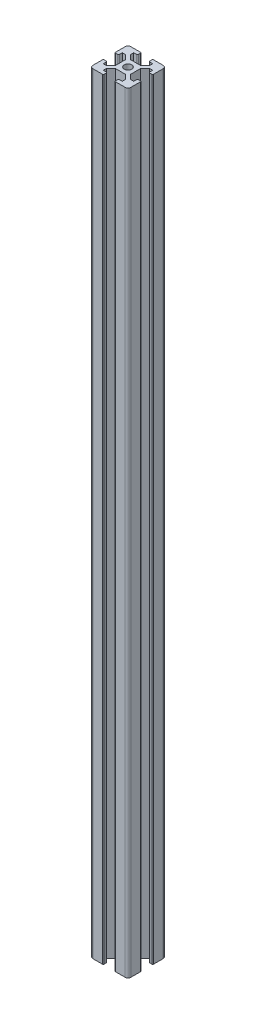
ISO-10303-21;
HEADER;
FILE_DESCRIPTION(('STEP AP214'),'2;1');
FILE_NAME('part.step','',(''),(''),'','','');
FILE_SCHEMA(('AUTOMOTIVE_DESIGN { 1 0 10303 214 1 1 1 1 }'));
ENDSEC;
DATA;
#1=APPLICATION_CONTEXT('core data for automotive mechanical design processes');
#2=APPLICATION_PROTOCOL_DEFINITION('international standard','automotive_design',2000,#1);
#3=PRODUCT_CONTEXT('',#1,'mechanical');
#4=PRODUCT('Part','Part','',(#3));
#5=PRODUCT_RELATED_PRODUCT_CATEGORY('part','',(#4));
#6=PRODUCT_DEFINITION_FORMATION('','',#4);
#7=PRODUCT_DEFINITION_CONTEXT('part definition',#1,'design');
#8=PRODUCT_DEFINITION('design','',#6,#7);
#9=PRODUCT_DEFINITION_SHAPE('','',#8);
#10=(LENGTH_UNIT() NAMED_UNIT(*) SI_UNIT(.MILLI.,.METRE.));
#11=(NAMED_UNIT(*) PLANE_ANGLE_UNIT() SI_UNIT($,.RADIAN.));
#12=(NAMED_UNIT(*) SI_UNIT($,.STERADIAN.) SOLID_ANGLE_UNIT());
#13=UNCERTAINTY_MEASURE_WITH_UNIT(LENGTH_MEASURE(1.E-05),#10,'distance_accuracy_value','');
#14=(GEOMETRIC_REPRESENTATION_CONTEXT(3) GLOBAL_UNCERTAINTY_ASSIGNED_CONTEXT((#13)) GLOBAL_UNIT_ASSIGNED_CONTEXT((#10,
#11,#12)) REPRESENTATION_CONTEXT('',''));
#15=CARTESIAN_POINT('',(0.,0.,0.));
#16=DIRECTION('',(0.,0.,1.));
#17=DIRECTION('',(1.,0.,0.));
#18=AXIS2_PLACEMENT_3D('',#15,#16,#17);
#19=CARTESIAN_POINT('',(0.,405.,0.));
#20=DIRECTION('',(0.,-1.,0.));
#21=DIRECTION('',(0.,0.,-1.));
#22=AXIS2_PLACEMENT_3D('',#19,#20,#21);
#23=PLANE('',#22);
#24=DIRECTION('',(0.,0.,1.));
#25=VECTOR('',#24,1.);
#26=CARTESIAN_POINT('',(3.,405.,10.));
#27=LINE('',#26,#25);
#28=CARTESIAN_POINT('',(3.,405.,8.5));
#29=VERTEX_POINT('',#28);
#30=CARTESIAN_POINT('',(3.,405.,9.5));
#31=VERTEX_POINT('',#30);
#32=EDGE_CURVE('E570',#29,#31,#27,.T.);
#33=ORIENTED_EDGE('',*,*,#32,.T.);
#34=CARTESIAN_POINT('',(3.5,405.,9.5));
#35=DIRECTION('',(0.,-1.,0.));
#36=DIRECTION('',(0.,0.,-1.));
#37=AXIS2_PLACEMENT_3D('',#34,#35,#36);
#38=CIRCLE('',#37,0.5);
#39=CARTESIAN_POINT('',(3.5,405.,10.));
#40=VERTEX_POINT('',#39);
#41=EDGE_CURVE('E1009',#31,#40,#38,.F.);
#42=ORIENTED_EDGE('',*,*,#41,.T.);
#43=DIRECTION('',(1.,0.,0.));
#44=VECTOR('',#43,1.);
#45=CARTESIAN_POINT('',(3.,405.,10.));
#46=LINE('',#45,#44);
#47=CARTESIAN_POINT('',(8.5,405.,10.));
#48=VERTEX_POINT('',#47);
#49=EDGE_CURVE('E573',#40,#48,#46,.T.);
#50=ORIENTED_EDGE('',*,*,#49,.T.);
#51=CARTESIAN_POINT('',(8.5,405.,8.5));
#52=DIRECTION('',(0.,-1.,0.));
#53=DIRECTION('',(0.,0.,-1.));
#54=AXIS2_PLACEMENT_3D('',#51,#52,#53);
#55=CIRCLE('',#54,1.5);
#56=CARTESIAN_POINT('',(10.,405.,8.5));
#57=VERTEX_POINT('',#56);
#58=EDGE_CURVE('E880',#48,#57,#55,.F.);
#59=ORIENTED_EDGE('',*,*,#58,.T.);
#60=DIRECTION('',(0.,0.,-1.));
#61=VECTOR('',#60,1.);
#62=CARTESIAN_POINT('',(10.,405.,10.));
#63=LINE('',#62,#61);
#64=CARTESIAN_POINT('',(10.,405.,3.5));
#65=VERTEX_POINT('',#64);
#66=EDGE_CURVE('E576',#57,#65,#63,.T.);
#67=ORIENTED_EDGE('',*,*,#66,.T.);
#68=CARTESIAN_POINT('',(9.5,405.,3.5));
#69=DIRECTION('',(0.,-1.,0.));
#70=DIRECTION('',(0.,0.,-1.));
#71=AXIS2_PLACEMENT_3D('',#68,#69,#70);
#72=CIRCLE('',#71,0.5);
#73=CARTESIAN_POINT('',(9.5,405.,3.));
#74=VERTEX_POINT('',#73);
#75=EDGE_CURVE('E992',#65,#74,#72,.F.);
#76=ORIENTED_EDGE('',*,*,#75,.T.);
#77=DIRECTION('',(-1.,0.,0.));
#78=VECTOR('',#77,1.);
#79=CARTESIAN_POINT('',(10.,405.,3.));
#80=LINE('',#79,#78);
#81=CARTESIAN_POINT('',(8.5,405.,3.));
#82=VERTEX_POINT('',#81);
#83=EDGE_CURVE('E580',#74,#82,#80,.T.);
#84=ORIENTED_EDGE('',*,*,#83,.T.);
#85=CARTESIAN_POINT('',(8.5,405.,3.5));
#86=DIRECTION('',(0.,-1.,0.));
#87=DIRECTION('',(0.,0.,-1.));
#88=AXIS2_PLACEMENT_3D('',#85,#86,#87);
#89=CIRCLE('',#88,0.5);
#90=CARTESIAN_POINT('',(8.,405.,3.5));
#91=VERTEX_POINT('',#90);
#92=EDGE_CURVE('E989',#82,#91,#89,.F.);
#93=ORIENTED_EDGE('',*,*,#92,.T.);
#94=DIRECTION('',(0.,0.,1.));
#95=VECTOR('',#94,1.);
#96=CARTESIAN_POINT('',(8.,405.,3.));
#97=LINE('',#96,#95);
#98=CARTESIAN_POINT('',(8.,405.,5.));
#99=VERTEX_POINT('',#98);
#100=EDGE_CURVE('E584',#91,#99,#97,.T.);
#101=ORIENTED_EDGE('',*,*,#100,.T.);
#102=DIRECTION('',(-1.,0.,0.));
#103=VECTOR('',#102,1.);
#104=CARTESIAN_POINT('',(8.,405.,5.));
#105=LINE('',#104,#103);
#106=CARTESIAN_POINT('',(6.41421356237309,405.,5.));
#107=VERTEX_POINT('',#106);
#108=EDGE_CURVE('E587',#99,#107,#105,.T.);
#109=ORIENTED_EDGE('',*,*,#108,.T.);
#110=DIRECTION('',(-0.707106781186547,0.,-0.707106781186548));
#111=VECTOR('',#110,1.);
#112=CARTESIAN_POINT('',(4.,405.,2.58578643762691));
#113=LINE('',#112,#111);
#114=CARTESIAN_POINT('',(4.,405.,2.58578643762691));
#115=VERTEX_POINT('',#114);
#116=EDGE_CURVE('E590',#107,#115,#113,.T.);
#117=ORIENTED_EDGE('',*,*,#116,.T.);
#118=DIRECTION('',(0.,0.,-1.));
#119=VECTOR('',#118,1.);
#120=CARTESIAN_POINT('',(4.,405.,2.58578643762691));
#121=LINE('',#120,#119);
#122=CARTESIAN_POINT('',(4.,405.,-2.58578643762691));
#123=VERTEX_POINT('',#122);
#124=EDGE_CURVE('E593',#115,#123,#121,.T.);
#125=ORIENTED_EDGE('',*,*,#124,.T.);
#126=DIRECTION('',(0.707106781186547,0.,-0.707106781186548));
#127=VECTOR('',#126,1.);
#128=CARTESIAN_POINT('',(4.,405.,-2.58578643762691));
#129=LINE('',#128,#127);
#130=CARTESIAN_POINT('',(6.41421356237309,405.,-5.));
#131=VERTEX_POINT('',#130);
#132=EDGE_CURVE('E596',#123,#131,#129,.T.);
#133=ORIENTED_EDGE('',*,*,#132,.T.);
#134=DIRECTION('',(1.,0.,0.));
#135=VECTOR('',#134,1.);
#136=CARTESIAN_POINT('',(8.,405.,-5.));
#137=LINE('',#136,#135);
#138=CARTESIAN_POINT('',(8.,405.,-5.));
#139=VERTEX_POINT('',#138);
#140=EDGE_CURVE('E599',#131,#139,#137,.T.);
#141=ORIENTED_EDGE('',*,*,#140,.T.);
#142=DIRECTION('',(0.,0.,1.));
#143=VECTOR('',#142,1.);
#144=CARTESIAN_POINT('',(8.,405.,-3.));
#145=LINE('',#144,#143);
#146=CARTESIAN_POINT('',(8.,405.,-3.5));
#147=VERTEX_POINT('',#146);
#148=EDGE_CURVE('E602',#139,#147,#145,.T.);
#149=ORIENTED_EDGE('',*,*,#148,.T.);
#150=CARTESIAN_POINT('',(8.5,405.,-3.5));
#151=DIRECTION('',(0.,-1.,0.));
#152=DIRECTION('',(0.,0.,-1.));
#153=AXIS2_PLACEMENT_3D('',#150,#151,#152);
#154=CIRCLE('',#153,0.5);
#155=CARTESIAN_POINT('',(8.5,405.,-3.));
#156=VERTEX_POINT('',#155);
#157=EDGE_CURVE('E975',#147,#156,#154,.F.);
#158=ORIENTED_EDGE('',*,*,#157,.T.);
#159=DIRECTION('',(1.,0.,0.));
#160=VECTOR('',#159,1.);
#161=CARTESIAN_POINT('',(10.,405.,-3.));
#162=LINE('',#161,#160);
#163=CARTESIAN_POINT('',(9.5,405.,-3.));
#164=VERTEX_POINT('',#163);
#165=EDGE_CURVE('E606',#156,#164,#162,.T.);
#166=ORIENTED_EDGE('',*,*,#165,.T.);
#167=CARTESIAN_POINT('',(9.5,405.,-3.5));
#168=DIRECTION('',(0.,-1.,0.));
#169=DIRECTION('',(0.,0.,-1.));
#170=AXIS2_PLACEMENT_3D('',#167,#168,#169);
#171=CIRCLE('',#170,0.5);
#172=CARTESIAN_POINT('',(10.,405.,-3.5));
#173=VERTEX_POINT('',#172);
#174=EDGE_CURVE('E972',#164,#173,#171,.F.);
#175=ORIENTED_EDGE('',*,*,#174,.T.);
#176=DIRECTION('',(0.,0.,-1.));
#177=VECTOR('',#176,1.);
#178=CARTESIAN_POINT('',(10.,405.,-10.));
#179=LINE('',#178,#177);
#180=CARTESIAN_POINT('',(10.,405.,-8.5));
#181=VERTEX_POINT('',#180);
#182=EDGE_CURVE('E758',#173,#181,#179,.T.);
#183=ORIENTED_EDGE('',*,*,#182,.T.);
#184=CARTESIAN_POINT('',(8.5,405.,-8.5));
#185=DIRECTION('',(0.,-1.,0.));
#186=DIRECTION('',(0.,0.,-1.));
#187=AXIS2_PLACEMENT_3D('',#184,#185,#186);
#188=CIRCLE('',#187,1.5);
#189=CARTESIAN_POINT('',(8.5,405.,-10.));
#190=VERTEX_POINT('',#189);
#191=EDGE_CURVE('E871',#181,#190,#188,.F.);
#192=ORIENTED_EDGE('',*,*,#191,.T.);
#193=DIRECTION('',(-1.,0.,0.));
#194=VECTOR('',#193,1.);
#195=CARTESIAN_POINT('',(3.,405.,-10.));
#196=LINE('',#195,#194);
#197=CARTESIAN_POINT('',(3.5,405.,-10.));
#198=VERTEX_POINT('',#197);
#199=EDGE_CURVE('E1109',#190,#198,#196,.T.);
#200=ORIENTED_EDGE('',*,*,#199,.T.);
#201=CARTESIAN_POINT('',(3.5,405.,-9.5));
#202=DIRECTION('',(0.,-1.,0.));
#203=DIRECTION('',(0.,0.,-1.));
#204=AXIS2_PLACEMENT_3D('',#201,#202,#203);
#205=CIRCLE('',#204,0.5);
#206=CARTESIAN_POINT('',(3.,405.,-9.5));
#207=VERTEX_POINT('',#206);
#208=EDGE_CURVE('E969',#198,#207,#205,.F.);
#209=ORIENTED_EDGE('',*,*,#208,.T.);
#210=DIRECTION('',(0.,0.,1.));
#211=VECTOR('',#210,1.);
#212=CARTESIAN_POINT('',(3.,405.,-10.));
#213=LINE('',#212,#211);
#214=CARTESIAN_POINT('',(3.,405.,-8.5));
#215=VERTEX_POINT('',#214);
#216=EDGE_CURVE('E462',#207,#215,#213,.T.);
#217=ORIENTED_EDGE('',*,*,#216,.T.);
#218=CARTESIAN_POINT('',(3.5,405.,-8.5));
#219=DIRECTION('',(0.,-1.,0.));
#220=DIRECTION('',(0.,0.,-1.));
#221=AXIS2_PLACEMENT_3D('',#218,#219,#220);
#222=CIRCLE('',#221,0.5);
#223=CARTESIAN_POINT('',(3.5,405.,-8.));
#224=VERTEX_POINT('',#223);
#225=EDGE_CURVE('E457',#215,#224,#222,.F.);
#226=ORIENTED_EDGE('',*,*,#225,.T.);
#227=DIRECTION('',(1.,0.,0.));
#228=VECTOR('',#227,1.);
#229=CARTESIAN_POINT('',(3.,405.,-8.));
#230=LINE('',#229,#228);
#231=CARTESIAN_POINT('',(5.,405.,-8.));
#232=VERTEX_POINT('',#231);
#233=EDGE_CURVE('E448',#224,#232,#230,.T.);
#234=ORIENTED_EDGE('',*,*,#233,.T.);
#235=DIRECTION('',(0.,0.,1.));
#236=VECTOR('',#235,1.);
#237=CARTESIAN_POINT('',(5.,405.,-8.));
#238=LINE('',#237,#236);
#239=CARTESIAN_POINT('',(5.,405.,-6.4142135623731));
#240=VERTEX_POINT('',#239);
#241=EDGE_CURVE('E453',#232,#240,#238,.T.);
#242=ORIENTED_EDGE('',*,*,#241,.T.);
#243=DIRECTION('',(-0.707106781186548,0.,0.707106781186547));
#244=VECTOR('',#243,1.);
#245=CARTESIAN_POINT('',(2.5857864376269,405.,-4.));
#246=LINE('',#245,#244);
#247=CARTESIAN_POINT('',(2.5857864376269,405.,-4.));
#248=VERTEX_POINT('',#247);
#249=EDGE_CURVE('E479',#240,#248,#246,.T.);
#250=ORIENTED_EDGE('',*,*,#249,.T.);
#251=DIRECTION('',(-1.,0.,0.));
#252=VECTOR('',#251,1.);
#253=CARTESIAN_POINT('',(-2.5857864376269,405.,-4.));
#254=LINE('',#253,#252);
#255=CARTESIAN_POINT('',(-2.5857864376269,405.,-4.));
#256=VERTEX_POINT('',#255);
#257=EDGE_CURVE('E482',#248,#256,#254,.T.);
#258=ORIENTED_EDGE('',*,*,#257,.T.);
#259=DIRECTION('',(-0.707106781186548,0.,-0.707106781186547));
#260=VECTOR('',#259,1.);
#261=CARTESIAN_POINT('',(-2.5857864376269,405.,-4.));
#262=LINE('',#261,#260);
#263=CARTESIAN_POINT('',(-5.,405.,-6.4142135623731));
#264=VERTEX_POINT('',#263);
#265=EDGE_CURVE('E488',#256,#264,#262,.T.);
#266=ORIENTED_EDGE('',*,*,#265,.T.);
#267=DIRECTION('',(0.,0.,-1.));
#268=VECTOR('',#267,1.);
#269=CARTESIAN_POINT('',(-5.,405.,-8.));
#270=LINE('',#269,#268);
#271=CARTESIAN_POINT('',(-5.,405.,-8.));
#272=VERTEX_POINT('',#271);
#273=EDGE_CURVE('E491',#264,#272,#270,.T.);
#274=ORIENTED_EDGE('',*,*,#273,.T.);
#275=DIRECTION('',(1.,0.,0.));
#276=VECTOR('',#275,1.);
#277=CARTESIAN_POINT('',(-3.,405.,-8.));
#278=LINE('',#277,#276);
#279=CARTESIAN_POINT('',(-3.5,405.,-8.));
#280=VERTEX_POINT('',#279);
#281=EDGE_CURVE('E494',#272,#280,#278,.T.);
#282=ORIENTED_EDGE('',*,*,#281,.T.);
#283=CARTESIAN_POINT('',(-3.5,405.,-8.5));
#284=DIRECTION('',(0.,-1.,0.));
#285=DIRECTION('',(0.,0.,-1.));
#286=AXIS2_PLACEMENT_3D('',#283,#284,#285);
#287=CIRCLE('',#286,0.5);
#288=CARTESIAN_POINT('',(-3.,405.,-8.5));
#289=VERTEX_POINT('',#288);
#290=EDGE_CURVE('E980',#280,#289,#287,.F.);
#291=ORIENTED_EDGE('',*,*,#290,.T.);
#292=DIRECTION('',(0.,0.,-1.));
#293=VECTOR('',#292,1.);
#294=CARTESIAN_POINT('',(-3.,405.,-10.));
#295=LINE('',#294,#293);
#296=CARTESIAN_POINT('',(-3.,405.,-9.5));
#297=VERTEX_POINT('',#296);
#298=EDGE_CURVE('E498',#289,#297,#295,.T.);
#299=ORIENTED_EDGE('',*,*,#298,.T.);
#300=CARTESIAN_POINT('',(-3.5,405.,-9.5));
#301=DIRECTION('',(0.,-1.,0.));
#302=DIRECTION('',(0.,0.,-1.));
#303=AXIS2_PLACEMENT_3D('',#300,#301,#302);
#304=CIRCLE('',#303,0.5);
#305=CARTESIAN_POINT('',(-3.5,405.,-10.));
#306=VERTEX_POINT('',#305);
#307=EDGE_CURVE('E966',#297,#306,#304,.F.);
#308=ORIENTED_EDGE('',*,*,#307,.T.);
#309=DIRECTION('',(-1.,0.,0.));
#310=VECTOR('',#309,1.);
#311=CARTESIAN_POINT('',(-10.,405.,-10.));
#312=LINE('',#311,#310);
#313=CARTESIAN_POINT('',(-8.5,405.,-10.));
#314=VERTEX_POINT('',#313);
#315=EDGE_CURVE('E502',#306,#314,#312,.T.);
#316=ORIENTED_EDGE('',*,*,#315,.T.);
#317=CARTESIAN_POINT('',(-8.5,405.,-8.5));
#318=DIRECTION('',(0.,-1.,0.));
#319=DIRECTION('',(0.,0.,-1.));
#320=AXIS2_PLACEMENT_3D('',#317,#318,#319);
#321=CIRCLE('',#320,1.5);
#322=CARTESIAN_POINT('',(-10.,405.,-8.5));
#323=VERTEX_POINT('',#322);
#324=EDGE_CURVE('E874',#314,#323,#321,.F.);
#325=ORIENTED_EDGE('',*,*,#324,.T.);
#326=DIRECTION('',(0.,0.,1.));
#327=VECTOR('',#326,1.);
#328=CARTESIAN_POINT('',(-10.,405.,-10.));
#329=LINE('',#328,#327);
#330=CARTESIAN_POINT('',(-10.,405.,-3.5));
#331=VERTEX_POINT('',#330);
#332=EDGE_CURVE('E505',#323,#331,#329,.T.);
#333=ORIENTED_EDGE('',*,*,#332,.T.);
#334=CARTESIAN_POINT('',(-9.5,405.,-3.5));
#335=DIRECTION('',(0.,-1.,0.));
#336=DIRECTION('',(0.,0.,-1.));
#337=AXIS2_PLACEMENT_3D('',#334,#335,#336);
#338=CIRCLE('',#337,0.5);
#339=CARTESIAN_POINT('',(-9.5,405.,-3.));
#340=VERTEX_POINT('',#339);
#341=EDGE_CURVE('E986',#331,#340,#338,.F.);
#342=ORIENTED_EDGE('',*,*,#341,.T.);
#343=DIRECTION('',(1.,0.,0.));
#344=VECTOR('',#343,1.);
#345=CARTESIAN_POINT('',(-10.,405.,-3.));
#346=LINE('',#345,#344);
#347=CARTESIAN_POINT('',(-8.5,405.,-3.));
#348=VERTEX_POINT('',#347);
#349=EDGE_CURVE('E509',#340,#348,#346,.T.);
#350=ORIENTED_EDGE('',*,*,#349,.T.);
#351=CARTESIAN_POINT('',(-8.5,405.,-3.5));
#352=DIRECTION('',(0.,-1.,0.));
#353=DIRECTION('',(0.,0.,-1.));
#354=AXIS2_PLACEMENT_3D('',#351,#352,#353);
#355=CIRCLE('',#354,0.5);
#356=CARTESIAN_POINT('',(-8.,405.,-3.5));
#357=VERTEX_POINT('',#356);
#358=EDGE_CURVE('E983',#348,#357,#355,.F.);
#359=ORIENTED_EDGE('',*,*,#358,.T.);
#360=DIRECTION('',(0.,0.,-1.));
#361=VECTOR('',#360,1.);
#362=CARTESIAN_POINT('',(-8.,405.,-3.));
#363=LINE('',#362,#361);
#364=CARTESIAN_POINT('',(-8.,405.,-5.));
#365=VERTEX_POINT('',#364);
#366=EDGE_CURVE('E513',#357,#365,#363,.T.);
#367=ORIENTED_EDGE('',*,*,#366,.T.);
#368=DIRECTION('',(1.,0.,0.));
#369=VECTOR('',#368,1.);
#370=CARTESIAN_POINT('',(-8.,405.,-5.));
#371=LINE('',#370,#369);
#372=CARTESIAN_POINT('',(-6.41421356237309,405.,-5.));
#373=VERTEX_POINT('',#372);
#374=EDGE_CURVE('E516',#365,#373,#371,.T.);
#375=ORIENTED_EDGE('',*,*,#374,.T.);
#376=DIRECTION('',(0.707106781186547,0.,0.707106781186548));
#377=VECTOR('',#376,1.);
#378=CARTESIAN_POINT('',(-4.,405.,-2.58578643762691));
#379=LINE('',#378,#377);
#380=CARTESIAN_POINT('',(-4.,405.,-2.58578643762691));
#381=VERTEX_POINT('',#380);
#382=EDGE_CURVE('E519',#373,#381,#379,.T.);
#383=ORIENTED_EDGE('',*,*,#382,.T.);
#384=DIRECTION('',(0.,0.,1.));
#385=VECTOR('',#384,1.);
#386=CARTESIAN_POINT('',(-4.,405.,2.58578643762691));
#387=LINE('',#386,#385);
#388=CARTESIAN_POINT('',(-4.,405.,2.58578643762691));
#389=VERTEX_POINT('',#388);
#390=EDGE_CURVE('E522',#381,#389,#387,.T.);
#391=ORIENTED_EDGE('',*,*,#390,.T.);
#392=DIRECTION('',(-0.707106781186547,0.,0.707106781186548));
#393=VECTOR('',#392,1.);
#394=CARTESIAN_POINT('',(-4.,405.,2.58578643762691));
#395=LINE('',#394,#393);
#396=CARTESIAN_POINT('',(-6.41421356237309,405.,5.));
#397=VERTEX_POINT('',#396);
#398=EDGE_CURVE('E525',#389,#397,#395,.T.);
#399=ORIENTED_EDGE('',*,*,#398,.T.);
#400=DIRECTION('',(-1.,0.,0.));
#401=VECTOR('',#400,1.);
#402=CARTESIAN_POINT('',(-8.,405.,5.));
#403=LINE('',#402,#401);
#404=CARTESIAN_POINT('',(-8.,405.,5.));
#405=VERTEX_POINT('',#404);
#406=EDGE_CURVE('E528',#397,#405,#403,.T.);
#407=ORIENTED_EDGE('',*,*,#406,.T.);
#408=DIRECTION('',(0.,0.,-1.));
#409=VECTOR('',#408,1.);
#410=CARTESIAN_POINT('',(-8.,405.,3.));
#411=LINE('',#410,#409);
#412=CARTESIAN_POINT('',(-8.,405.,3.5));
#413=VERTEX_POINT('',#412);
#414=EDGE_CURVE('E531',#405,#413,#411,.T.);
#415=ORIENTED_EDGE('',*,*,#414,.T.);
#416=CARTESIAN_POINT('',(-8.5,405.,3.5));
#417=DIRECTION('',(0.,-1.,0.));
#418=DIRECTION('',(0.,0.,-1.));
#419=AXIS2_PLACEMENT_3D('',#416,#417,#418);
#420=CIRCLE('',#419,0.5);
#421=CARTESIAN_POINT('',(-8.5,405.,3.));
#422=VERTEX_POINT('',#421);
#423=EDGE_CURVE('E995',#413,#422,#420,.F.);
#424=ORIENTED_EDGE('',*,*,#423,.T.);
#425=DIRECTION('',(-1.,0.,0.));
#426=VECTOR('',#425,1.);
#427=CARTESIAN_POINT('',(-10.,405.,3.));
#428=LINE('',#427,#426);
#429=CARTESIAN_POINT('',(-9.5,405.,3.));
#430=VERTEX_POINT('',#429);
#431=EDGE_CURVE('E535',#422,#430,#428,.T.);
#432=ORIENTED_EDGE('',*,*,#431,.T.);
#433=CARTESIAN_POINT('',(-9.5,405.,3.5));
#434=DIRECTION('',(0.,-1.,0.));
#435=DIRECTION('',(0.,0.,-1.));
#436=AXIS2_PLACEMENT_3D('',#433,#434,#435);
#437=CIRCLE('',#436,0.5);
#438=CARTESIAN_POINT('',(-10.,405.,3.5));
#439=VERTEX_POINT('',#438);
#440=EDGE_CURVE('E998',#430,#439,#437,.F.);
#441=ORIENTED_EDGE('',*,*,#440,.T.);
#442=DIRECTION('',(0.,0.,1.));
#443=VECTOR('',#442,1.);
#444=CARTESIAN_POINT('',(-10.,405.,3.));
#445=LINE('',#444,#443);
#446=CARTESIAN_POINT('',(-10.,405.,8.5));
#447=VERTEX_POINT('',#446);
#448=EDGE_CURVE('E539',#439,#447,#445,.T.);
#449=ORIENTED_EDGE('',*,*,#448,.T.);
#450=CARTESIAN_POINT('',(-8.5,405.,8.5));
#451=DIRECTION('',(0.,-1.,0.));
#452=DIRECTION('',(0.,0.,-1.));
#453=AXIS2_PLACEMENT_3D('',#450,#451,#452);
#454=CIRCLE('',#453,1.5);
#455=CARTESIAN_POINT('',(-8.5,405.,10.));
#456=VERTEX_POINT('',#455);
#457=EDGE_CURVE('E877',#447,#456,#454,.F.);
#458=ORIENTED_EDGE('',*,*,#457,.T.);
#459=DIRECTION('',(1.,0.,0.));
#460=VECTOR('',#459,1.);
#461=CARTESIAN_POINT('',(-10.,405.,10.));
#462=LINE('',#461,#460);
#463=CARTESIAN_POINT('',(-3.5,405.,10.));
#464=VERTEX_POINT('',#463);
#465=EDGE_CURVE('E542',#456,#464,#462,.T.);
#466=ORIENTED_EDGE('',*,*,#465,.T.);
#467=CARTESIAN_POINT('',(-3.5,405.,9.5));
#468=DIRECTION('',(0.,-1.,0.));
#469=DIRECTION('',(0.,0.,-1.));
#470=AXIS2_PLACEMENT_3D('',#467,#468,#469);
#471=CIRCLE('',#470,0.5);
#472=CARTESIAN_POINT('',(-3.,405.,9.5));
#473=VERTEX_POINT('',#472);
#474=EDGE_CURVE('E1003',#464,#473,#471,.F.);
#475=ORIENTED_EDGE('',*,*,#474,.T.);
#476=DIRECTION('',(0.,0.,-1.));
#477=VECTOR('',#476,1.);
#478=CARTESIAN_POINT('',(-3.,405.,10.));
#479=LINE('',#478,#477);
#480=CARTESIAN_POINT('',(-3.,405.,8.5));
#481=VERTEX_POINT('',#480);
#482=EDGE_CURVE('E546',#473,#481,#479,.T.);
#483=ORIENTED_EDGE('',*,*,#482,.T.);
#484=CARTESIAN_POINT('',(-3.5,405.,8.5));
#485=DIRECTION('',(0.,-1.,0.));
#486=DIRECTION('',(0.,0.,-1.));
#487=AXIS2_PLACEMENT_3D('',#484,#485,#486);
#488=CIRCLE('',#487,0.5);
#489=CARTESIAN_POINT('',(-3.5,405.,8.));
#490=VERTEX_POINT('',#489);
#491=EDGE_CURVE('E69',#481,#490,#488,.F.);
#492=ORIENTED_EDGE('',*,*,#491,.T.);
#493=DIRECTION('',(-1.,0.,0.));
#494=VECTOR('',#493,1.);
#495=CARTESIAN_POINT('',(-3.,405.,8.));
#496=LINE('',#495,#494);
#497=CARTESIAN_POINT('',(-5.,405.,8.));
#498=VERTEX_POINT('',#497);
#499=EDGE_CURVE('E549',#490,#498,#496,.T.);
#500=ORIENTED_EDGE('',*,*,#499,.T.);
#501=DIRECTION('',(0.,0.,-1.));
#502=VECTOR('',#501,1.);
#503=CARTESIAN_POINT('',(-5.,405.,8.));
#504=LINE('',#503,#502);
#505=CARTESIAN_POINT('',(-5.,405.,6.4142135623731));
#506=VERTEX_POINT('',#505);
#507=EDGE_CURVE('E552',#498,#506,#504,.T.);
#508=ORIENTED_EDGE('',*,*,#507,.T.);
#509=DIRECTION('',(0.707106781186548,0.,-0.707106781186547));
#510=VECTOR('',#509,1.);
#511=CARTESIAN_POINT('',(-2.5857864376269,405.,4.));
#512=LINE('',#511,#510);
#513=CARTESIAN_POINT('',(-2.5857864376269,405.,4.));
#514=VERTEX_POINT('',#513);
#515=EDGE_CURVE('E555',#506,#514,#512,.T.);
#516=ORIENTED_EDGE('',*,*,#515,.T.);
#517=DIRECTION('',(1.,0.,0.));
#518=VECTOR('',#517,1.);
#519=CARTESIAN_POINT('',(-2.5857864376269,405.,4.));
#520=LINE('',#519,#518);
#521=CARTESIAN_POINT('',(2.5857864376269,405.,4.));
#522=VERTEX_POINT('',#521);
#523=EDGE_CURVE('E558',#514,#522,#520,.T.);
#524=ORIENTED_EDGE('',*,*,#523,.T.);
#525=DIRECTION('',(0.707106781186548,0.,0.707106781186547));
#526=VECTOR('',#525,1.);
#527=CARTESIAN_POINT('',(2.5857864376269,405.,4.));
#528=LINE('',#527,#526);
#529=CARTESIAN_POINT('',(5.,405.,6.4142135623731));
#530=VERTEX_POINT('',#529);
#531=EDGE_CURVE('E561',#522,#530,#528,.T.);
#532=ORIENTED_EDGE('',*,*,#531,.T.);
#533=DIRECTION('',(0.,0.,1.));
#534=VECTOR('',#533,1.);
#535=CARTESIAN_POINT('',(5.,405.,8.));
#536=LINE('',#535,#534);
#537=CARTESIAN_POINT('',(5.,405.,8.));
#538=VERTEX_POINT('',#537);
#539=EDGE_CURVE('E564',#530,#538,#536,.T.);
#540=ORIENTED_EDGE('',*,*,#539,.T.);
#541=DIRECTION('',(-1.,0.,0.));
#542=VECTOR('',#541,1.);
#543=CARTESIAN_POINT('',(3.,405.,8.));
#544=LINE('',#543,#542);
#545=CARTESIAN_POINT('',(3.5,405.,8.));
#546=VERTEX_POINT('',#545);
#547=EDGE_CURVE('E567',#538,#546,#544,.T.);
#548=ORIENTED_EDGE('',*,*,#547,.T.);
#549=CARTESIAN_POINT('',(3.5,405.,8.5));
#550=DIRECTION('',(0.,-1.,0.));
#551=DIRECTION('',(0.,0.,-1.));
#552=AXIS2_PLACEMENT_3D('',#549,#550,#551);
#553=CIRCLE('',#552,0.5);
#554=EDGE_CURVE('E1006',#546,#29,#553,.F.);
#555=ORIENTED_EDGE('',*,*,#554,.T.);
#556=EDGE_LOOP('',(#33,#42,#50,#59,#67,#76,#84,#93,#101,#109,#117,#125,#133,#141,#149,#158,#166,
#175,#183,#192,#200,#209,#217,#226,#234,#242,#250,#258,#266,#274,#282,#291,#299,#308,#316,#325,
#333,#342,#350,#359,#367,#375,#383,#391,#399,#407,#415,#424,#432,#441,#449,#458,#466,#475,#483,
#492,#500,#508,#516,#524,#532,#540,#548,#555));
#557=FACE_BOUND('',#556,.T.);
#558=CARTESIAN_POINT('',(0.,405.,0.));
#559=DIRECTION('',(0.,1.,0.));
#560=DIRECTION('',(0.,0.,1.));
#561=AXIS2_PLACEMENT_3D('',#558,#559,#560);
#562=CIRCLE('',#561,2.);
#563=CARTESIAN_POINT('',(0.,405.,2.));
#564=VERTEX_POINT('',#563);
#565=EDGE_CURVE('E615',#564,#564,#562,.T.);
#566=ORIENTED_EDGE('',*,*,#565,.F.);
#567=EDGE_LOOP('',(#566));
#568=FACE_BOUND('',#567,.T.);
#569=ADVANCED_FACE('F45',(#557,#568),#23,.F.);
#570=CARTESIAN_POINT('',(0.,0.,0.));
#571=DIRECTION('',(0.,-1.,0.));
#572=DIRECTION('',(0.,0.,-1.));
#573=AXIS2_PLACEMENT_3D('',#570,#571,#572);
#574=PLANE('',#573);
#575=DIRECTION('',(1.,0.,0.));
#576=VECTOR('',#575,1.);
#577=CARTESIAN_POINT('',(3.,0.,10.));
#578=LINE('',#577,#576);
#579=CARTESIAN_POINT('',(3.5,0.,10.));
#580=VERTEX_POINT('',#579);
#581=CARTESIAN_POINT('',(8.5,0.,10.));
#582=VERTEX_POINT('',#581);
#583=EDGE_CURVE('E721',#580,#582,#578,.T.);
#584=ORIENTED_EDGE('',*,*,#583,.F.);
#585=CARTESIAN_POINT('',(3.5,0.,9.5));
#586=DIRECTION('',(0.,-1.,0.));
#587=DIRECTION('',(0.,0.,-1.));
#588=AXIS2_PLACEMENT_3D('',#585,#586,#587);
#589=CIRCLE('',#588,0.5);
#590=CARTESIAN_POINT('',(3.,0.,9.5));
#591=VERTEX_POINT('',#590);
#592=EDGE_CURVE('E956',#580,#591,#589,.T.);
#593=ORIENTED_EDGE('',*,*,#592,.T.);
#594=DIRECTION('',(0.,0.,1.));
#595=VECTOR('',#594,1.);
#596=CARTESIAN_POINT('',(3.,0.,10.));
#597=LINE('',#596,#595);
#598=CARTESIAN_POINT('',(3.,0.,8.5));
#599=VERTEX_POINT('',#598);
#600=EDGE_CURVE('E717',#599,#591,#597,.T.);
#601=ORIENTED_EDGE('',*,*,#600,.F.);
#602=CARTESIAN_POINT('',(3.5,0.,8.5));
#603=DIRECTION('',(0.,-1.,0.));
#604=DIRECTION('',(0.,0.,-1.));
#605=AXIS2_PLACEMENT_3D('',#602,#603,#604);
#606=CIRCLE('',#605,0.5);
#607=CARTESIAN_POINT('',(3.5,0.,8.));
#608=VERTEX_POINT('',#607);
#609=EDGE_CURVE('E953',#599,#608,#606,.T.);
#610=ORIENTED_EDGE('',*,*,#609,.T.);
#611=DIRECTION('',(-1.,0.,0.));
#612=VECTOR('',#611,1.);
#613=CARTESIAN_POINT('',(3.,0.,8.));
#614=LINE('',#613,#612);
#615=CARTESIAN_POINT('',(5.,0.,8.));
#616=VERTEX_POINT('',#615);
#617=EDGE_CURVE('E714',#616,#608,#614,.T.);
#618=ORIENTED_EDGE('',*,*,#617,.F.);
#619=DIRECTION('',(0.,0.,1.));
#620=VECTOR('',#619,1.);
#621=CARTESIAN_POINT('',(5.,0.,8.));
#622=LINE('',#621,#620);
#623=CARTESIAN_POINT('',(5.,0.,6.4142135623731));
#624=VERTEX_POINT('',#623);
#625=EDGE_CURVE('E711',#624,#616,#622,.T.);
#626=ORIENTED_EDGE('',*,*,#625,.F.);
#627=DIRECTION('',(0.707106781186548,0.,0.707106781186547));
#628=VECTOR('',#627,1.);
#629=CARTESIAN_POINT('',(2.5857864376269,0.,4.));
#630=LINE('',#629,#628);
#631=CARTESIAN_POINT('',(2.5857864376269,0.,4.));
#632=VERTEX_POINT('',#631);
#633=EDGE_CURVE('E708',#632,#624,#630,.T.);
#634=ORIENTED_EDGE('',*,*,#633,.F.);
#635=DIRECTION('',(1.,0.,0.));
#636=VECTOR('',#635,1.);
#637=CARTESIAN_POINT('',(-2.5857864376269,0.,4.));
#638=LINE('',#637,#636);
#639=CARTESIAN_POINT('',(-2.5857864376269,0.,4.));
#640=VERTEX_POINT('',#639);
#641=EDGE_CURVE('E705',#640,#632,#638,.T.);
#642=ORIENTED_EDGE('',*,*,#641,.F.);
#643=DIRECTION('',(0.707106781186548,0.,-0.707106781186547));
#644=VECTOR('',#643,1.);
#645=CARTESIAN_POINT('',(-2.5857864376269,0.,4.));
#646=LINE('',#645,#644);
#647=CARTESIAN_POINT('',(-5.,0.,6.4142135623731));
#648=VERTEX_POINT('',#647);
#649=EDGE_CURVE('E702',#648,#640,#646,.T.);
#650=ORIENTED_EDGE('',*,*,#649,.F.);
#651=DIRECTION('',(0.,0.,-1.));
#652=VECTOR('',#651,1.);
#653=CARTESIAN_POINT('',(-5.,0.,8.));
#654=LINE('',#653,#652);
#655=CARTESIAN_POINT('',(-5.,0.,8.));
#656=VERTEX_POINT('',#655);
#657=EDGE_CURVE('E699',#656,#648,#654,.T.);
#658=ORIENTED_EDGE('',*,*,#657,.F.);
#659=DIRECTION('',(-1.,0.,0.));
#660=VECTOR('',#659,1.);
#661=CARTESIAN_POINT('',(-3.,0.,8.));
#662=LINE('',#661,#660);
#663=CARTESIAN_POINT('',(-3.5,0.,8.));
#664=VERTEX_POINT('',#663);
#665=EDGE_CURVE('E696',#664,#656,#662,.T.);
#666=ORIENTED_EDGE('',*,*,#665,.F.);
#667=CARTESIAN_POINT('',(-3.5,0.,8.5));
#668=DIRECTION('',(0.,-1.,0.));
#669=DIRECTION('',(0.,0.,-1.));
#670=AXIS2_PLACEMENT_3D('',#667,#668,#669);
#671=CIRCLE('',#670,0.5);
#672=CARTESIAN_POINT('',(-3.,0.,8.5));
#673=VERTEX_POINT('',#672);
#674=EDGE_CURVE('E947',#664,#673,#671,.T.);
#675=ORIENTED_EDGE('',*,*,#674,.T.);
#676=DIRECTION('',(0.,0.,-1.));
#677=VECTOR('',#676,1.);
#678=CARTESIAN_POINT('',(-3.,0.,10.));
#679=LINE('',#678,#677);
#680=CARTESIAN_POINT('',(-3.,0.,9.5));
#681=VERTEX_POINT('',#680);
#682=EDGE_CURVE('E692',#681,#673,#679,.T.);
#683=ORIENTED_EDGE('',*,*,#682,.F.);
#684=CARTESIAN_POINT('',(-3.5,0.,9.5));
#685=DIRECTION('',(0.,-1.,0.));
#686=DIRECTION('',(0.,0.,-1.));
#687=AXIS2_PLACEMENT_3D('',#684,#685,#686);
#688=CIRCLE('',#687,0.5);
#689=CARTESIAN_POINT('',(-3.5,0.,10.));
#690=VERTEX_POINT('',#689);
#691=EDGE_CURVE('E950',#681,#690,#688,.T.);
#692=ORIENTED_EDGE('',*,*,#691,.T.);
#693=DIRECTION('',(1.,0.,0.));
#694=VECTOR('',#693,1.);
#695=CARTESIAN_POINT('',(-10.,0.,10.));
#696=LINE('',#695,#694);
#697=CARTESIAN_POINT('',(-8.5,0.,10.));
#698=VERTEX_POINT('',#697);
#699=EDGE_CURVE('E688',#698,#690,#696,.T.);
#700=ORIENTED_EDGE('',*,*,#699,.F.);
#701=CARTESIAN_POINT('',(-8.5,0.,8.5));
#702=DIRECTION('',(0.,-1.,0.));
#703=DIRECTION('',(0.,0.,-1.));
#704=AXIS2_PLACEMENT_3D('',#701,#702,#703);
#705=CIRCLE('',#704,1.5);
#706=CARTESIAN_POINT('',(-10.,0.,8.5));
#707=VERTEX_POINT('',#706);
#708=EDGE_CURVE('E859',#698,#707,#705,.T.);
#709=ORIENTED_EDGE('',*,*,#708,.T.);
#710=DIRECTION('',(0.,0.,1.));
#711=VECTOR('',#710,1.);
#712=CARTESIAN_POINT('',(-10.,0.,3.));
#713=LINE('',#712,#711);
#714=CARTESIAN_POINT('',(-10.,0.,3.5));
#715=VERTEX_POINT('',#714);
#716=EDGE_CURVE('E685',#715,#707,#713,.T.);
#717=ORIENTED_EDGE('',*,*,#716,.F.);
#718=CARTESIAN_POINT('',(-9.5,0.,3.5));
#719=DIRECTION('',(0.,-1.,0.));
#720=DIRECTION('',(0.,0.,-1.));
#721=AXIS2_PLACEMENT_3D('',#718,#719,#720);
#722=CIRCLE('',#721,0.5);
#723=CARTESIAN_POINT('',(-9.5,0.,3.));
#724=VERTEX_POINT('',#723);
#725=EDGE_CURVE('E944',#715,#724,#722,.T.);
#726=ORIENTED_EDGE('',*,*,#725,.T.);
#727=DIRECTION('',(-1.,0.,0.));
#728=VECTOR('',#727,1.);
#729=CARTESIAN_POINT('',(-10.,0.,3.));
#730=LINE('',#729,#728);
#731=CARTESIAN_POINT('',(-8.5,0.,3.));
#732=VERTEX_POINT('',#731);
#733=EDGE_CURVE('E681',#732,#724,#730,.T.);
#734=ORIENTED_EDGE('',*,*,#733,.F.);
#735=CARTESIAN_POINT('',(-8.5,0.,3.5));
#736=DIRECTION('',(0.,-1.,0.));
#737=DIRECTION('',(0.,0.,-1.));
#738=AXIS2_PLACEMENT_3D('',#735,#736,#737);
#739=CIRCLE('',#738,0.5);
#740=CARTESIAN_POINT('',(-8.,0.,3.5));
#741=VERTEX_POINT('',#740);
#742=EDGE_CURVE('E941',#732,#741,#739,.T.);
#743=ORIENTED_EDGE('',*,*,#742,.T.);
#744=DIRECTION('',(0.,0.,-1.));
#745=VECTOR('',#744,1.);
#746=CARTESIAN_POINT('',(-8.,0.,3.));
#747=LINE('',#746,#745);
#748=CARTESIAN_POINT('',(-8.,0.,5.));
#749=VERTEX_POINT('',#748);
#750=EDGE_CURVE('E677',#749,#741,#747,.T.);
#751=ORIENTED_EDGE('',*,*,#750,.F.);
#752=DIRECTION('',(-1.,0.,0.));
#753=VECTOR('',#752,1.);
#754=CARTESIAN_POINT('',(-8.,0.,5.));
#755=LINE('',#754,#753);
#756=CARTESIAN_POINT('',(-6.41421356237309,0.,5.));
#757=VERTEX_POINT('',#756);
#758=EDGE_CURVE('E674',#757,#749,#755,.T.);
#759=ORIENTED_EDGE('',*,*,#758,.F.);
#760=DIRECTION('',(-0.707106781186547,0.,0.707106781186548));
#761=VECTOR('',#760,1.);
#762=CARTESIAN_POINT('',(-4.,0.,2.58578643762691));
#763=LINE('',#762,#761);
#764=CARTESIAN_POINT('',(-4.,0.,2.58578643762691));
#765=VERTEX_POINT('',#764);
#766=EDGE_CURVE('E671',#765,#757,#763,.T.);
#767=ORIENTED_EDGE('',*,*,#766,.F.);
#768=DIRECTION('',(0.,0.,1.));
#769=VECTOR('',#768,1.);
#770=CARTESIAN_POINT('',(-4.,0.,2.58578643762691));
#771=LINE('',#770,#769);
#772=CARTESIAN_POINT('',(-4.,0.,-2.58578643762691));
#773=VERTEX_POINT('',#772);
#774=EDGE_CURVE('E668',#773,#765,#771,.T.);
#775=ORIENTED_EDGE('',*,*,#774,.F.);
#776=DIRECTION('',(0.707106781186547,0.,0.707106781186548));
#777=VECTOR('',#776,1.);
#778=CARTESIAN_POINT('',(-4.,0.,-2.58578643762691));
#779=LINE('',#778,#777);
#780=CARTESIAN_POINT('',(-6.41421356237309,0.,-5.));
#781=VERTEX_POINT('',#780);
#782=EDGE_CURVE('E665',#781,#773,#779,.T.);
#783=ORIENTED_EDGE('',*,*,#782,.F.);
#784=DIRECTION('',(1.,0.,0.));
#785=VECTOR('',#784,1.);
#786=CARTESIAN_POINT('',(-8.,0.,-5.));
#787=LINE('',#786,#785);
#788=CARTESIAN_POINT('',(-8.,0.,-5.));
#789=VERTEX_POINT('',#788);
#790=EDGE_CURVE('E662',#789,#781,#787,.T.);
#791=ORIENTED_EDGE('',*,*,#790,.F.);
#792=DIRECTION('',(0.,0.,-1.));
#793=VECTOR('',#792,1.);
#794=CARTESIAN_POINT('',(-8.,0.,-3.));
#795=LINE('',#794,#793);
#796=CARTESIAN_POINT('',(-8.,0.,-3.5));
#797=VERTEX_POINT('',#796);
#798=EDGE_CURVE('E659',#797,#789,#795,.T.);
#799=ORIENTED_EDGE('',*,*,#798,.F.);
#800=CARTESIAN_POINT('',(-8.5,0.,-3.5));
#801=DIRECTION('',(0.,-1.,0.));
#802=DIRECTION('',(0.,0.,-1.));
#803=AXIS2_PLACEMENT_3D('',#800,#801,#802);
#804=CIRCLE('',#803,0.5);
#805=CARTESIAN_POINT('',(-8.5,0.,-3.));
#806=VERTEX_POINT('',#805);
#807=EDGE_CURVE('E929',#797,#806,#804,.T.);
#808=ORIENTED_EDGE('',*,*,#807,.T.);
#809=DIRECTION('',(1.,0.,0.));
#810=VECTOR('',#809,1.);
#811=CARTESIAN_POINT('',(-10.,0.,-3.));
#812=LINE('',#811,#810);
#813=CARTESIAN_POINT('',(-9.5,0.,-3.));
#814=VERTEX_POINT('',#813);
#815=EDGE_CURVE('E655',#814,#806,#812,.T.);
#816=ORIENTED_EDGE('',*,*,#815,.F.);
#817=CARTESIAN_POINT('',(-9.5,0.,-3.5));
#818=DIRECTION('',(0.,-1.,0.));
#819=DIRECTION('',(0.,0.,-1.));
#820=AXIS2_PLACEMENT_3D('',#817,#818,#819);
#821=CIRCLE('',#820,0.5);
#822=CARTESIAN_POINT('',(-10.,0.,-3.5));
#823=VERTEX_POINT('',#822);
#824=EDGE_CURVE('E932',#814,#823,#821,.T.);
#825=ORIENTED_EDGE('',*,*,#824,.T.);
#826=DIRECTION('',(0.,0.,1.));
#827=VECTOR('',#826,1.);
#828=CARTESIAN_POINT('',(-10.,0.,-10.));
#829=LINE('',#828,#827);
#830=CARTESIAN_POINT('',(-10.,0.,-8.5));
#831=VERTEX_POINT('',#830);
#832=EDGE_CURVE('E651',#831,#823,#829,.T.);
#833=ORIENTED_EDGE('',*,*,#832,.F.);
#834=CARTESIAN_POINT('',(-8.5,0.,-8.5));
#835=DIRECTION('',(0.,-1.,0.));
#836=DIRECTION('',(0.,0.,-1.));
#837=AXIS2_PLACEMENT_3D('',#834,#835,#836);
#838=CIRCLE('',#837,1.5);
#839=CARTESIAN_POINT('',(-8.5,0.,-10.));
#840=VERTEX_POINT('',#839);
#841=EDGE_CURVE('E855',#831,#840,#838,.T.);
#842=ORIENTED_EDGE('',*,*,#841,.T.);
#843=DIRECTION('',(-1.,0.,0.));
#844=VECTOR('',#843,1.);
#845=CARTESIAN_POINT('',(-10.,0.,-10.));
#846=LINE('',#845,#844);
#847=CARTESIAN_POINT('',(-3.5,0.,-10.));
#848=VERTEX_POINT('',#847);
#849=EDGE_CURVE('E648',#848,#840,#846,.T.);
#850=ORIENTED_EDGE('',*,*,#849,.F.);
#851=CARTESIAN_POINT('',(-3.5,0.,-9.5));
#852=DIRECTION('',(0.,-1.,0.));
#853=DIRECTION('',(0.,0.,-1.));
#854=AXIS2_PLACEMENT_3D('',#851,#852,#853);
#855=CIRCLE('',#854,0.5);
#856=CARTESIAN_POINT('',(-3.,0.,-9.5));
#857=VERTEX_POINT('',#856);
#858=EDGE_CURVE('E911',#848,#857,#855,.T.);
#859=ORIENTED_EDGE('',*,*,#858,.T.);
#860=DIRECTION('',(0.,0.,-1.));
#861=VECTOR('',#860,1.);
#862=CARTESIAN_POINT('',(-3.,0.,-10.));
#863=LINE('',#862,#861);
#864=CARTESIAN_POINT('',(-3.,0.,-8.5));
#865=VERTEX_POINT('',#864);
#866=EDGE_CURVE('E644',#865,#857,#863,.T.);
#867=ORIENTED_EDGE('',*,*,#866,.F.);
#868=CARTESIAN_POINT('',(-3.5,0.,-8.5));
#869=DIRECTION('',(0.,-1.,0.));
#870=DIRECTION('',(0.,0.,-1.));
#871=AXIS2_PLACEMENT_3D('',#868,#869,#870);
#872=CIRCLE('',#871,0.5);
#873=CARTESIAN_POINT('',(-3.5,0.,-8.));
#874=VERTEX_POINT('',#873);
#875=EDGE_CURVE('E926',#865,#874,#872,.T.);
#876=ORIENTED_EDGE('',*,*,#875,.T.);
#877=DIRECTION('',(1.,0.,0.));
#878=VECTOR('',#877,1.);
#879=CARTESIAN_POINT('',(-3.,0.,-8.));
#880=LINE('',#879,#878);
#881=CARTESIAN_POINT('',(-5.,0.,-8.));
#882=VERTEX_POINT('',#881);
#883=EDGE_CURVE('E640',#882,#874,#880,.T.);
#884=ORIENTED_EDGE('',*,*,#883,.F.);
#885=DIRECTION('',(0.,0.,-1.));
#886=VECTOR('',#885,1.);
#887=CARTESIAN_POINT('',(-5.,0.,-8.));
#888=LINE('',#887,#886);
#889=CARTESIAN_POINT('',(-5.,0.,-6.4142135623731));
#890=VERTEX_POINT('',#889);
#891=EDGE_CURVE('E637',#890,#882,#888,.T.);
#892=ORIENTED_EDGE('',*,*,#891,.F.);
#893=DIRECTION('',(-0.707106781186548,0.,-0.707106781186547));
#894=VECTOR('',#893,1.);
#895=CARTESIAN_POINT('',(-2.5857864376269,0.,-4.));
#896=LINE('',#895,#894);
#897=CARTESIAN_POINT('',(-2.5857864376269,0.,-4.));
#898=VERTEX_POINT('',#897);
#899=EDGE_CURVE('E634',#898,#890,#896,.T.);
#900=ORIENTED_EDGE('',*,*,#899,.F.);
#901=DIRECTION('',(-1.,0.,0.));
#902=VECTOR('',#901,1.);
#903=CARTESIAN_POINT('',(-2.5857864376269,0.,-4.));
#904=LINE('',#903,#902);
#905=CARTESIAN_POINT('',(2.5857864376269,0.,-4.));
#906=VERTEX_POINT('',#905);
#907=EDGE_CURVE('E631',#906,#898,#904,.T.);
#908=ORIENTED_EDGE('',*,*,#907,.F.);
#909=DIRECTION('',(-0.707106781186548,0.,0.707106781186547));
#910=VECTOR('',#909,1.);
#911=CARTESIAN_POINT('',(2.5857864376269,0.,-4.));
#912=LINE('',#911,#910);
#913=CARTESIAN_POINT('',(5.,0.,-6.4142135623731));
#914=VERTEX_POINT('',#913);
#915=EDGE_CURVE('E628',#914,#906,#912,.T.);
#916=ORIENTED_EDGE('',*,*,#915,.F.);
#917=DIRECTION('',(0.,0.,1.));
#918=VECTOR('',#917,1.);
#919=CARTESIAN_POINT('',(5.,0.,-8.));
#920=LINE('',#919,#918);
#921=CARTESIAN_POINT('',(5.,0.,-8.));
#922=VERTEX_POINT('',#921);
#923=EDGE_CURVE('E625',#922,#914,#920,.T.);
#924=ORIENTED_EDGE('',*,*,#923,.F.);
#925=DIRECTION('',(1.,0.,0.));
#926=VECTOR('',#925,1.);
#927=CARTESIAN_POINT('',(3.,0.,-8.));
#928=LINE('',#927,#926);
#929=CARTESIAN_POINT('',(3.5,0.,-8.));
#930=VERTEX_POINT('',#929);
#931=EDGE_CURVE('E468',#930,#922,#928,.T.);
#932=ORIENTED_EDGE('',*,*,#931,.F.);
#933=CARTESIAN_POINT('',(3.5,0.,-8.5));
#934=DIRECTION('',(0.,-1.,0.));
#935=DIRECTION('',(0.,0.,-1.));
#936=AXIS2_PLACEMENT_3D('',#933,#934,#935);
#937=CIRCLE('',#936,0.5);
#938=CARTESIAN_POINT('',(3.,0.,-8.5));
#939=VERTEX_POINT('',#938);
#940=EDGE_CURVE('E923',#930,#939,#937,.T.);
#941=ORIENTED_EDGE('',*,*,#940,.T.);
#942=DIRECTION('',(0.,0.,1.));
#943=VECTOR('',#942,1.);
#944=CARTESIAN_POINT('',(3.,0.,-10.));
#945=LINE('',#944,#943);
#946=CARTESIAN_POINT('',(3.,0.,-9.5));
#947=VERTEX_POINT('',#946);
#948=EDGE_CURVE('E619',#947,#939,#945,.T.);
#949=ORIENTED_EDGE('',*,*,#948,.F.);
#950=CARTESIAN_POINT('',(3.5,0.,-9.5));
#951=DIRECTION('',(0.,-1.,0.));
#952=DIRECTION('',(0.,0.,-1.));
#953=AXIS2_PLACEMENT_3D('',#950,#951,#952);
#954=CIRCLE('',#953,0.5);
#955=CARTESIAN_POINT('',(3.5,0.,-10.));
#956=VERTEX_POINT('',#955);
#957=EDGE_CURVE('E914',#947,#956,#954,.T.);
#958=ORIENTED_EDGE('',*,*,#957,.T.);
#959=DIRECTION('',(-1.,0.,0.));
#960=VECTOR('',#959,1.);
#961=CARTESIAN_POINT('',(3.,0.,-10.));
#962=LINE('',#961,#960);
#963=CARTESIAN_POINT('',(8.5,0.,-10.));
#964=VERTEX_POINT('',#963);
#965=EDGE_CURVE('E614',#964,#956,#962,.T.);
#966=ORIENTED_EDGE('',*,*,#965,.F.);
#967=CARTESIAN_POINT('',(8.5,0.,-8.5));
#968=DIRECTION('',(0.,-1.,0.));
#969=DIRECTION('',(0.,0.,-1.));
#970=AXIS2_PLACEMENT_3D('',#967,#968,#969);
#971=CIRCLE('',#970,1.5);
#972=CARTESIAN_POINT('',(10.,0.,-8.5));
#973=VERTEX_POINT('',#972);
#974=EDGE_CURVE('E851',#964,#973,#971,.T.);
#975=ORIENTED_EDGE('',*,*,#974,.T.);
#976=DIRECTION('',(0.,0.,-1.));
#977=VECTOR('',#976,1.);
#978=CARTESIAN_POINT('',(10.,0.,-10.));
#979=LINE('',#978,#977);
#980=CARTESIAN_POINT('',(10.,0.,-3.5));
#981=VERTEX_POINT('',#980);
#982=EDGE_CURVE('E611',#981,#973,#979,.T.);
#983=ORIENTED_EDGE('',*,*,#982,.F.);
#984=CARTESIAN_POINT('',(9.5,0.,-3.5));
#985=DIRECTION('',(0.,-1.,0.));
#986=DIRECTION('',(0.,0.,-1.));
#987=AXIS2_PLACEMENT_3D('',#984,#985,#986);
#988=CIRCLE('',#987,0.5);
#989=CARTESIAN_POINT('',(9.5,0.,-3.));
#990=VERTEX_POINT('',#989);
#991=EDGE_CURVE('E917',#981,#990,#988,.T.);
#992=ORIENTED_EDGE('',*,*,#991,.T.);
#993=DIRECTION('',(1.,0.,0.));
#994=VECTOR('',#993,1.);
#995=CARTESIAN_POINT('',(10.,0.,-3.));
#996=LINE('',#995,#994);
#997=CARTESIAN_POINT('',(8.5,0.,-3.));
#998=VERTEX_POINT('',#997);
#999=EDGE_CURVE('E754',#998,#990,#996,.T.);
#1000=ORIENTED_EDGE('',*,*,#999,.F.);
#1001=CARTESIAN_POINT('',(8.5,0.,-3.5));
#1002=DIRECTION('',(0.,-1.,0.));
#1003=DIRECTION('',(0.,0.,-1.));
#1004=AXIS2_PLACEMENT_3D('',#1001,#1002,#1003);
#1005=CIRCLE('',#1004,0.5);
#1006=CARTESIAN_POINT('',(8.,0.,-3.5));
#1007=VERTEX_POINT('',#1006);
#1008=EDGE_CURVE('E920',#998,#1007,#1005,.T.);
#1009=ORIENTED_EDGE('',*,*,#1008,.T.);
#1010=DIRECTION('',(0.,0.,1.));
#1011=VECTOR('',#1010,1.);
#1012=CARTESIAN_POINT('',(8.,0.,-3.));
#1013=LINE('',#1012,#1011);
#1014=CARTESIAN_POINT('',(8.,0.,-5.));
#1015=VERTEX_POINT('',#1014);
#1016=EDGE_CURVE('E750',#1015,#1007,#1013,.T.);
#1017=ORIENTED_EDGE('',*,*,#1016,.F.);
#1018=DIRECTION('',(1.,0.,0.));
#1019=VECTOR('',#1018,1.);
#1020=CARTESIAN_POINT('',(8.,0.,-5.));
#1021=LINE('',#1020,#1019);
#1022=CARTESIAN_POINT('',(6.41421356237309,0.,-5.));
#1023=VERTEX_POINT('',#1022);
#1024=EDGE_CURVE('E747',#1023,#1015,#1021,.T.);
#1025=ORIENTED_EDGE('',*,*,#1024,.F.);
#1026=DIRECTION('',(0.707106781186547,0.,-0.707106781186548));
#1027=VECTOR('',#1026,1.);
#1028=CARTESIAN_POINT('',(4.,0.,-2.58578643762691));
#1029=LINE('',#1028,#1027);
#1030=CARTESIAN_POINT('',(4.,0.,-2.58578643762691));
#1031=VERTEX_POINT('',#1030);
#1032=EDGE_CURVE('E744',#1031,#1023,#1029,.T.);
#1033=ORIENTED_EDGE('',*,*,#1032,.F.);
#1034=DIRECTION('',(0.,0.,-1.));
#1035=VECTOR('',#1034,1.);
#1036=CARTESIAN_POINT('',(4.,0.,2.58578643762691));
#1037=LINE('',#1036,#1035);
#1038=CARTESIAN_POINT('',(4.,0.,2.58578643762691));
#1039=VERTEX_POINT('',#1038);
#1040=EDGE_CURVE('E741',#1039,#1031,#1037,.T.);
#1041=ORIENTED_EDGE('',*,*,#1040,.F.);
#1042=DIRECTION('',(-0.707106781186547,0.,-0.707106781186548));
#1043=VECTOR('',#1042,1.);
#1044=CARTESIAN_POINT('',(4.,0.,2.58578643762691));
#1045=LINE('',#1044,#1043);
#1046=CARTESIAN_POINT('',(6.41421356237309,0.,5.));
#1047=VERTEX_POINT('',#1046);
#1048=EDGE_CURVE('E738',#1047,#1039,#1045,.T.);
#1049=ORIENTED_EDGE('',*,*,#1048,.F.);
#1050=DIRECTION('',(-1.,0.,0.));
#1051=VECTOR('',#1050,1.);
#1052=CARTESIAN_POINT('',(8.,0.,5.));
#1053=LINE('',#1052,#1051);
#1054=CARTESIAN_POINT('',(8.,0.,5.));
#1055=VERTEX_POINT('',#1054);
#1056=EDGE_CURVE('E735',#1055,#1047,#1053,.T.);
#1057=ORIENTED_EDGE('',*,*,#1056,.F.);
#1058=DIRECTION('',(0.,0.,1.));
#1059=VECTOR('',#1058,1.);
#1060=CARTESIAN_POINT('',(8.,0.,3.));
#1061=LINE('',#1060,#1059);
#1062=CARTESIAN_POINT('',(8.,0.,3.5));
#1063=VERTEX_POINT('',#1062);
#1064=EDGE_CURVE('E732',#1063,#1055,#1061,.T.);
#1065=ORIENTED_EDGE('',*,*,#1064,.F.);
#1066=CARTESIAN_POINT('',(8.5,0.,3.5));
#1067=DIRECTION('',(0.,-1.,0.));
#1068=DIRECTION('',(0.,0.,-1.));
#1069=AXIS2_PLACEMENT_3D('',#1066,#1067,#1068);
#1070=CIRCLE('',#1069,0.5);
#1071=CARTESIAN_POINT('',(8.5,0.,3.));
#1072=VERTEX_POINT('',#1071);
#1073=EDGE_CURVE('E935',#1063,#1072,#1070,.T.);
#1074=ORIENTED_EDGE('',*,*,#1073,.T.);
#1075=DIRECTION('',(-1.,0.,0.));
#1076=VECTOR('',#1075,1.);
#1077=CARTESIAN_POINT('',(10.,0.,3.));
#1078=LINE('',#1077,#1076);
#1079=CARTESIAN_POINT('',(9.5,0.,3.));
#1080=VERTEX_POINT('',#1079);
#1081=EDGE_CURVE('E728',#1080,#1072,#1078,.T.);
#1082=ORIENTED_EDGE('',*,*,#1081,.F.);
#1083=CARTESIAN_POINT('',(9.5,0.,3.5));
#1084=DIRECTION('',(0.,-1.,0.));
#1085=DIRECTION('',(0.,0.,-1.));
#1086=AXIS2_PLACEMENT_3D('',#1083,#1084,#1085);
#1087=CIRCLE('',#1086,0.5);
#1088=CARTESIAN_POINT('',(10.,0.,3.5));
#1089=VERTEX_POINT('',#1088);
#1090=EDGE_CURVE('E938',#1080,#1089,#1087,.T.);
#1091=ORIENTED_EDGE('',*,*,#1090,.T.);
#1092=DIRECTION('',(0.,0.,-1.));
#1093=VECTOR('',#1092,1.);
#1094=CARTESIAN_POINT('',(10.,0.,10.));
#1095=LINE('',#1094,#1093);
#1096=CARTESIAN_POINT('',(10.,0.,8.5));
#1097=VERTEX_POINT('',#1096);
#1098=EDGE_CURVE('E724',#1097,#1089,#1095,.T.);
#1099=ORIENTED_EDGE('',*,*,#1098,.F.);
#1100=CARTESIAN_POINT('',(8.5,0.,8.5));
#1101=DIRECTION('',(0.,-1.,0.));
#1102=DIRECTION('',(0.,0.,-1.));
#1103=AXIS2_PLACEMENT_3D('',#1100,#1101,#1102);
#1104=CIRCLE('',#1103,1.5);
#1105=EDGE_CURVE('E863',#1097,#582,#1104,.T.);
#1106=ORIENTED_EDGE('',*,*,#1105,.T.);
#1107=EDGE_LOOP('',(#584,#593,#601,#610,#618,#626,#634,#642,#650,#658,#666,#675,#683,#692,#700,
#709,#717,#726,#734,#743,#751,#759,#767,#775,#783,#791,#799,#808,#816,#825,#833,#842,#850,#859,
#867,#876,#884,#892,#900,#908,#916,#924,#932,#941,#949,#958,#966,#975,#983,#992,#1000,#1009,
#1017,#1025,#1033,#1041,#1049,#1057,#1065,#1074,#1082,#1091,#1099,#1106));
#1108=FACE_BOUND('',#1107,.T.);
#1109=CARTESIAN_POINT('',(0.,0.,0.));
#1110=DIRECTION('',(0.,1.,0.));
#1111=DIRECTION('',(0.,0.,1.));
#1112=AXIS2_PLACEMENT_3D('',#1109,#1110,#1111);
#1113=CIRCLE('',#1112,2.);
#1114=CARTESIAN_POINT('',(0.,0.,2.));
#1115=VERTEX_POINT('',#1114);
#1116=EDGE_CURVE('E1134',#1115,#1115,#1113,.T.);
#1117=ORIENTED_EDGE('',*,*,#1116,.T.);
#1118=EDGE_LOOP('',(#1117));
#1119=FACE_BOUND('',#1118,.T.);
#1120=ADVANCED_FACE('F1126',(#1108,#1119),#574,.T.);
#1121=CARTESIAN_POINT('',(10.,405.,-10.));
#1122=DIRECTION('',(-1.,0.,0.));
#1123=DIRECTION('',(0.,0.,1.));
#1124=AXIS2_PLACEMENT_3D('',#1121,#1122,#1123);
#1125=PLANE('',#1124);
#1126=ORIENTED_EDGE('',*,*,#182,.F.);
#1127=DIRECTION('',(0.,-1.,0.));
#1128=VECTOR('',#1127,1.);
#1129=CARTESIAN_POINT('',(10.,405.,-3.5));
#1130=LINE('',#1129,#1128);
#1131=EDGE_CURVE('E1100',#173,#981,#1130,.T.);
#1132=ORIENTED_EDGE('',*,*,#1131,.T.);
#1133=ORIENTED_EDGE('',*,*,#982,.T.);
#1134=DIRECTION('',(0.,-1.,0.));
#1135=VECTOR('',#1134,1.);
#1136=CARTESIAN_POINT('',(10.,405.,-8.5));
#1137=LINE('',#1136,#1135);
#1138=EDGE_CURVE('E903',#973,#181,#1137,.F.);
#1139=ORIENTED_EDGE('',*,*,#1138,.T.);
#1140=EDGE_LOOP('',(#1126,#1132,#1133,#1139));
#1141=FACE_BOUND('',#1140,.T.);
#1142=ADVANCED_FACE('F1150',(#1141),#1125,.F.);
#1143=CARTESIAN_POINT('',(3.,405.,-10.));
#1144=DIRECTION('',(0.,0.,1.));
#1145=DIRECTION('',(1.,0.,0.));
#1146=AXIS2_PLACEMENT_3D('',#1143,#1144,#1145);
#1147=PLANE('',#1146);
#1148=ORIENTED_EDGE('',*,*,#965,.T.);
#1149=DIRECTION('',(0.,-1.,0.));
#1150=VECTOR('',#1149,1.);
#1151=CARTESIAN_POINT('',(3.5,405.,-10.));
#1152=LINE('',#1151,#1150);
#1153=EDGE_CURVE('E54',#956,#198,#1152,.F.);
#1154=ORIENTED_EDGE('',*,*,#1153,.T.);
#1155=ORIENTED_EDGE('',*,*,#199,.F.);
#1156=DIRECTION('',(0.,-1.,0.));
#1157=VECTOR('',#1156,1.);
#1158=CARTESIAN_POINT('',(8.5,405.,-10.));
#1159=LINE('',#1158,#1157);
#1160=EDGE_CURVE('E899',#190,#964,#1159,.T.);
#1161=ORIENTED_EDGE('',*,*,#1160,.T.);
#1162=EDGE_LOOP('',(#1148,#1154,#1155,#1161));
#1163=FACE_BOUND('',#1162,.T.);
#1164=ADVANCED_FACE('F1108',(#1163),#1147,.F.);
#1165=CARTESIAN_POINT('',(3.,405.,-10.));
#1166=DIRECTION('',(1.,0.,0.));
#1167=DIRECTION('',(0.,0.,-1.));
#1168=AXIS2_PLACEMENT_3D('',#1165,#1166,#1167);
#1169=PLANE('',#1168);
#1170=ORIENTED_EDGE('',*,*,#948,.T.);
#1171=DIRECTION('',(0.,-1.,0.));
#1172=VECTOR('',#1171,1.);
#1173=CARTESIAN_POINT('',(3.,405.,-8.5));
#1174=LINE('',#1173,#1172);
#1175=EDGE_CURVE('E1087',#939,#215,#1174,.F.);
#1176=ORIENTED_EDGE('',*,*,#1175,.T.);
#1177=ORIENTED_EDGE('',*,*,#216,.F.);
#1178=DIRECTION('',(0.,-1.,0.));
#1179=VECTOR('',#1178,1.);
#1180=CARTESIAN_POINT('',(3.,405.,-9.5));
#1181=LINE('',#1180,#1179);
#1182=EDGE_CURVE('E1083',#207,#947,#1181,.T.);
#1183=ORIENTED_EDGE('',*,*,#1182,.T.);
#1184=EDGE_LOOP('',(#1170,#1176,#1177,#1183));
#1185=FACE_BOUND('',#1184,.T.);
#1186=ADVANCED_FACE('F1122',(#1185),#1169,.F.);
#1187=CARTESIAN_POINT('',(3.,405.,-8.));
#1188=DIRECTION('',(0.,0.,-1.));
#1189=DIRECTION('',(-1.,0.,0.));
#1190=AXIS2_PLACEMENT_3D('',#1187,#1188,#1189);
#1191=PLANE('',#1190);
#1192=ORIENTED_EDGE('',*,*,#233,.F.);
#1193=DIRECTION('',(0.,-1.,0.));
#1194=VECTOR('',#1193,1.);
#1195=CARTESIAN_POINT('',(3.5,405.,-8.));
#1196=LINE('',#1195,#1194);
#1197=EDGE_CURVE('E1080',#224,#930,#1196,.T.);
#1198=ORIENTED_EDGE('',*,*,#1197,.T.);
#1199=ORIENTED_EDGE('',*,*,#931,.T.);
#1200=DIRECTION('',(0.,-1.,0.));
#1201=VECTOR('',#1200,1.);
#1202=CARTESIAN_POINT('',(5.,405.,-8.));
#1203=LINE('',#1202,#1201);
#1204=EDGE_CURVE('E465',#232,#922,#1203,.T.);
#1205=ORIENTED_EDGE('',*,*,#1204,.F.);
#1206=EDGE_LOOP('',(#1192,#1198,#1199,#1205));
#1207=FACE_BOUND('',#1206,.T.);
#1208=ADVANCED_FACE('F466',(#1207),#1191,.F.);
#1209=CARTESIAN_POINT('',(5.,405.,-8.));
#1210=DIRECTION('',(1.,0.,0.));
#1211=DIRECTION('',(0.,0.,-1.));
#1212=AXIS2_PLACEMENT_3D('',#1209,#1210,#1211);
#1213=PLANE('',#1212);
#1214=ORIENTED_EDGE('',*,*,#923,.T.);
#1215=DIRECTION('',(0.,-1.,0.));
#1216=VECTOR('',#1215,1.);
#1217=CARTESIAN_POINT('',(5.,405.,-6.4142135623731));
#1218=LINE('',#1217,#1216);
#1219=EDGE_CURVE('E473',#240,#914,#1218,.T.);
#1220=ORIENTED_EDGE('',*,*,#1219,.F.);
#1221=ORIENTED_EDGE('',*,*,#241,.F.);
#1222=ORIENTED_EDGE('',*,*,#1204,.T.);
#1223=EDGE_LOOP('',(#1214,#1220,#1221,#1222));
#1224=FACE_BOUND('',#1223,.T.);
#1225=ADVANCED_FACE('F475',(#1224),#1213,.F.);
#1226=CARTESIAN_POINT('',(2.5857864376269,405.,-4.));
#1227=DIRECTION('',(0.707106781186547,0.,0.707106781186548));
#1228=DIRECTION('',(0.707106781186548,0.,-0.707106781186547));
#1229=AXIS2_PLACEMENT_3D('',#1226,#1227,#1228);
#1230=PLANE('',#1229);
#1231=ORIENTED_EDGE('',*,*,#915,.T.);
#1232=DIRECTION('',(0.,-1.,0.));
#1233=VECTOR('',#1232,1.);
#1234=CARTESIAN_POINT('',(2.5857864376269,405.,-4.));
#1235=LINE('',#1234,#1233);
#1236=EDGE_CURVE('E842',#248,#906,#1235,.T.);
#1237=ORIENTED_EDGE('',*,*,#1236,.F.);
#1238=ORIENTED_EDGE('',*,*,#249,.F.);
#1239=ORIENTED_EDGE('',*,*,#1219,.T.);
#1240=EDGE_LOOP('',(#1231,#1237,#1238,#1239));
#1241=FACE_BOUND('',#1240,.T.);
#1242=ADVANCED_FACE('F1304',(#1241),#1230,.F.);
#1243=CARTESIAN_POINT('',(-2.5857864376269,405.,-4.));
#1244=DIRECTION('',(0.,0.,1.));
#1245=DIRECTION('',(1.,0.,0.));
#1246=AXIS2_PLACEMENT_3D('',#1243,#1244,#1245);
#1247=PLANE('',#1246);
#1248=ORIENTED_EDGE('',*,*,#907,.T.);
#1249=DIRECTION('',(0.,-1.,0.));
#1250=VECTOR('',#1249,1.);
#1251=CARTESIAN_POINT('',(-2.5857864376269,405.,-4.));
#1252=LINE('',#1251,#1250);
#1253=EDGE_CURVE('E838',#256,#898,#1252,.T.);
#1254=ORIENTED_EDGE('',*,*,#1253,.F.);
#1255=ORIENTED_EDGE('',*,*,#257,.F.);
#1256=ORIENTED_EDGE('',*,*,#1236,.T.);
#1257=EDGE_LOOP('',(#1248,#1254,#1255,#1256));
#1258=FACE_BOUND('',#1257,.T.);
#1259=ADVANCED_FACE('F1300',(#1258),#1247,.F.);
#1260=CARTESIAN_POINT('',(-2.5857864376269,405.,-4.));
#1261=DIRECTION('',(-0.707106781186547,0.,0.707106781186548));
#1262=DIRECTION('',(0.707106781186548,0.,0.707106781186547));
#1263=AXIS2_PLACEMENT_3D('',#1260,#1261,#1262);
#1264=PLANE('',#1263);
#1265=ORIENTED_EDGE('',*,*,#899,.T.);
#1266=DIRECTION('',(0.,-1.,0.));
#1267=VECTOR('',#1266,1.);
#1268=CARTESIAN_POINT('',(-5.,405.,-6.4142135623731));
#1269=LINE('',#1268,#1267);
#1270=EDGE_CURVE('E834',#264,#890,#1269,.T.);
#1271=ORIENTED_EDGE('',*,*,#1270,.F.);
#1272=ORIENTED_EDGE('',*,*,#265,.F.);
#1273=ORIENTED_EDGE('',*,*,#1253,.T.);
#1274=EDGE_LOOP('',(#1265,#1271,#1272,#1273));
#1275=FACE_BOUND('',#1274,.T.);
#1276=ADVANCED_FACE('F1296',(#1275),#1264,.F.);
#1277=CARTESIAN_POINT('',(-5.,405.,-8.));
#1278=DIRECTION('',(-1.,0.,0.));
#1279=DIRECTION('',(0.,0.,1.));
#1280=AXIS2_PLACEMENT_3D('',#1277,#1278,#1279);
#1281=PLANE('',#1280);
#1282=ORIENTED_EDGE('',*,*,#891,.T.);
#1283=DIRECTION('',(0.,-1.,0.));
#1284=VECTOR('',#1283,1.);
#1285=CARTESIAN_POINT('',(-5.,405.,-8.));
#1286=LINE('',#1285,#1284);
#1287=EDGE_CURVE('E830',#272,#882,#1286,.T.);
#1288=ORIENTED_EDGE('',*,*,#1287,.F.);
#1289=ORIENTED_EDGE('',*,*,#273,.F.);
#1290=ORIENTED_EDGE('',*,*,#1270,.T.);
#1291=EDGE_LOOP('',(#1282,#1288,#1289,#1290));
#1292=FACE_BOUND('',#1291,.T.);
#1293=ADVANCED_FACE('F1292',(#1292),#1281,.F.);
#1294=CARTESIAN_POINT('',(-3.,405.,-8.));
#1295=DIRECTION('',(0.,0.,-1.));
#1296=DIRECTION('',(-1.,0.,0.));
#1297=AXIS2_PLACEMENT_3D('',#1294,#1295,#1296);
#1298=PLANE('',#1297);
#1299=ORIENTED_EDGE('',*,*,#883,.T.);
#1300=DIRECTION('',(0.,-1.,0.));
#1301=VECTOR('',#1300,1.);
#1302=CARTESIAN_POINT('',(-3.5,405.,-8.));
#1303=LINE('',#1302,#1301);
#1304=EDGE_CURVE('E1077',#874,#280,#1303,.F.);
#1305=ORIENTED_EDGE('',*,*,#1304,.T.);
#1306=ORIENTED_EDGE('',*,*,#281,.F.);
#1307=ORIENTED_EDGE('',*,*,#1287,.T.);
#1308=EDGE_LOOP('',(#1299,#1305,#1306,#1307));
#1309=FACE_BOUND('',#1308,.T.);
#1310=ADVANCED_FACE('F1288',(#1309),#1298,.F.);
#1311=CARTESIAN_POINT('',(-3.,405.,-10.));
#1312=DIRECTION('',(-1.,0.,0.));
#1313=DIRECTION('',(0.,0.,1.));
#1314=AXIS2_PLACEMENT_3D('',#1311,#1312,#1313);
#1315=PLANE('',#1314);
#1316=ORIENTED_EDGE('',*,*,#298,.F.);
#1317=DIRECTION('',(0.,-1.,0.));
#1318=VECTOR('',#1317,1.);
#1319=CARTESIAN_POINT('',(-3.,405.,-8.5));
#1320=LINE('',#1319,#1318);
#1321=EDGE_CURVE('E1073',#289,#865,#1320,.T.);
#1322=ORIENTED_EDGE('',*,*,#1321,.T.);
#1323=ORIENTED_EDGE('',*,*,#866,.T.);
#1324=DIRECTION('',(0.,-1.,0.));
#1325=VECTOR('',#1324,1.);
#1326=CARTESIAN_POINT('',(-3.,405.,-9.5));
#1327=LINE('',#1326,#1325);
#1328=EDGE_CURVE('E1070',#857,#297,#1327,.F.);
#1329=ORIENTED_EDGE('',*,*,#1328,.T.);
#1330=EDGE_LOOP('',(#1316,#1322,#1323,#1329));
#1331=FACE_BOUND('',#1330,.T.);
#1332=ADVANCED_FACE('F1284',(#1331),#1315,.F.);
#1333=CARTESIAN_POINT('',(-10.,405.,-10.));
#1334=DIRECTION('',(0.,0.,1.));
#1335=DIRECTION('',(1.,0.,0.));
#1336=AXIS2_PLACEMENT_3D('',#1333,#1334,#1335);
#1337=PLANE('',#1336);
#1338=ORIENTED_EDGE('',*,*,#315,.F.);
#1339=DIRECTION('',(0.,-1.,0.));
#1340=VECTOR('',#1339,1.);
#1341=CARTESIAN_POINT('',(-3.5,405.,-10.));
#1342=LINE('',#1341,#1340);
#1343=EDGE_CURVE('E11',#306,#848,#1342,.T.);
#1344=ORIENTED_EDGE('',*,*,#1343,.T.);
#1345=ORIENTED_EDGE('',*,*,#849,.T.);
#1346=DIRECTION('',(0.,-1.,0.));
#1347=VECTOR('',#1346,1.);
#1348=CARTESIAN_POINT('',(-8.5,405.,-10.));
#1349=LINE('',#1348,#1347);
#1350=EDGE_CURVE('E895',#840,#314,#1349,.F.);
#1351=ORIENTED_EDGE('',*,*,#1350,.T.);
#1352=EDGE_LOOP('',(#1338,#1344,#1345,#1351));
#1353=FACE_BOUND('',#1352,.T.);
#1354=ADVANCED_FACE('F1280',(#1353),#1337,.F.);
#1355=CARTESIAN_POINT('',(-10.,405.,-10.));
#1356=DIRECTION('',(1.,0.,0.));
#1357=DIRECTION('',(0.,0.,-1.));
#1358=AXIS2_PLACEMENT_3D('',#1355,#1356,#1357);
#1359=PLANE('',#1358);
#1360=ORIENTED_EDGE('',*,*,#832,.T.);
#1361=DIRECTION('',(0.,-1.,0.));
#1362=VECTOR('',#1361,1.);
#1363=CARTESIAN_POINT('',(-10.,405.,-3.5));
#1364=LINE('',#1363,#1362);
#1365=EDGE_CURVE('E1063',#823,#331,#1364,.F.);
#1366=ORIENTED_EDGE('',*,*,#1365,.T.);
#1367=ORIENTED_EDGE('',*,*,#332,.F.);
#1368=DIRECTION('',(0.,-1.,0.));
#1369=VECTOR('',#1368,1.);
#1370=CARTESIAN_POINT('',(-10.,405.,-8.5));
#1371=LINE('',#1370,#1369);
#1372=EDGE_CURVE('E891',#323,#831,#1371,.T.);
#1373=ORIENTED_EDGE('',*,*,#1372,.T.);
#1374=EDGE_LOOP('',(#1360,#1366,#1367,#1373));
#1375=FACE_BOUND('',#1374,.T.);
#1376=ADVANCED_FACE('F1276',(#1375),#1359,.F.);
#1377=CARTESIAN_POINT('',(-10.,405.,-3.));
#1378=DIRECTION('',(0.,0.,-1.));
#1379=DIRECTION('',(-1.,0.,0.));
#1380=AXIS2_PLACEMENT_3D('',#1377,#1378,#1379);
#1381=PLANE('',#1380);
#1382=ORIENTED_EDGE('',*,*,#349,.F.);
#1383=DIRECTION('',(0.,-1.,0.));
#1384=VECTOR('',#1383,1.);
#1385=CARTESIAN_POINT('',(-9.5,405.,-3.));
#1386=LINE('',#1385,#1384);
#1387=EDGE_CURVE('E1059',#340,#814,#1386,.T.);
#1388=ORIENTED_EDGE('',*,*,#1387,.T.);
#1389=ORIENTED_EDGE('',*,*,#815,.T.);
#1390=DIRECTION('',(0.,-1.,0.));
#1391=VECTOR('',#1390,1.);
#1392=CARTESIAN_POINT('',(-8.5,405.,-3.));
#1393=LINE('',#1392,#1391);
#1394=EDGE_CURVE('E1056',#806,#348,#1393,.F.);
#1395=ORIENTED_EDGE('',*,*,#1394,.T.);
#1396=EDGE_LOOP('',(#1382,#1388,#1389,#1395));
#1397=FACE_BOUND('',#1396,.T.);
#1398=ADVANCED_FACE('F1272',(#1397),#1381,.F.);
#1399=CARTESIAN_POINT('',(-8.,405.,-3.));
#1400=DIRECTION('',(-1.,0.,0.));
#1401=DIRECTION('',(0.,0.,1.));
#1402=AXIS2_PLACEMENT_3D('',#1399,#1400,#1401);
#1403=PLANE('',#1402);
#1404=ORIENTED_EDGE('',*,*,#366,.F.);
#1405=DIRECTION('',(0.,-1.,0.));
#1406=VECTOR('',#1405,1.);
#1407=CARTESIAN_POINT('',(-8.,405.,-3.5));
#1408=LINE('',#1407,#1406);
#1409=EDGE_CURVE('E1066',#357,#797,#1408,.T.);
#1410=ORIENTED_EDGE('',*,*,#1409,.T.);
#1411=ORIENTED_EDGE('',*,*,#798,.T.);
#1412=DIRECTION('',(0.,-1.,0.));
#1413=VECTOR('',#1412,1.);
#1414=CARTESIAN_POINT('',(-8.,405.,-5.));
#1415=LINE('',#1414,#1413);
#1416=EDGE_CURVE('E826',#365,#789,#1415,.T.);
#1417=ORIENTED_EDGE('',*,*,#1416,.F.);
#1418=EDGE_LOOP('',(#1404,#1410,#1411,#1417));
#1419=FACE_BOUND('',#1418,.T.);
#1420=ADVANCED_FACE('F1268',(#1419),#1403,.F.);
#1421=CARTESIAN_POINT('',(-8.,405.,-5.));
#1422=DIRECTION('',(0.,0.,-1.));
#1423=DIRECTION('',(-1.,0.,0.));
#1424=AXIS2_PLACEMENT_3D('',#1421,#1422,#1423);
#1425=PLANE('',#1424);
#1426=ORIENTED_EDGE('',*,*,#790,.T.);
#1427=DIRECTION('',(0.,-1.,0.));
#1428=VECTOR('',#1427,1.);
#1429=CARTESIAN_POINT('',(-6.41421356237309,405.,-5.));
#1430=LINE('',#1429,#1428);
#1431=EDGE_CURVE('E822',#373,#781,#1430,.T.);
#1432=ORIENTED_EDGE('',*,*,#1431,.F.);
#1433=ORIENTED_EDGE('',*,*,#374,.F.);
#1434=ORIENTED_EDGE('',*,*,#1416,.T.);
#1435=EDGE_LOOP('',(#1426,#1432,#1433,#1434));
#1436=FACE_BOUND('',#1435,.T.);
#1437=ADVANCED_FACE('F1264',(#1436),#1425,.F.);
#1438=CARTESIAN_POINT('',(-4.,405.,-2.58578643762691));
#1439=DIRECTION('',(0.707106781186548,0.,-0.707106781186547));
#1440=DIRECTION('',(-0.707106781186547,0.,-0.707106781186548));
#1441=AXIS2_PLACEMENT_3D('',#1438,#1439,#1440);
#1442=PLANE('',#1441);
#1443=ORIENTED_EDGE('',*,*,#782,.T.);
#1444=DIRECTION('',(0.,-1.,0.));
#1445=VECTOR('',#1444,1.);
#1446=CARTESIAN_POINT('',(-4.,405.,-2.58578643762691));
#1447=LINE('',#1446,#1445);
#1448=EDGE_CURVE('E818',#381,#773,#1447,.T.);
#1449=ORIENTED_EDGE('',*,*,#1448,.F.);
#1450=ORIENTED_EDGE('',*,*,#382,.F.);
#1451=ORIENTED_EDGE('',*,*,#1431,.T.);
#1452=EDGE_LOOP('',(#1443,#1449,#1450,#1451));
#1453=FACE_BOUND('',#1452,.T.);
#1454=ADVANCED_FACE('F1260',(#1453),#1442,.F.);
#1455=CARTESIAN_POINT('',(-4.,405.,2.58578643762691));
#1456=DIRECTION('',(1.,0.,0.));
#1457=DIRECTION('',(0.,0.,-1.));
#1458=AXIS2_PLACEMENT_3D('',#1455,#1456,#1457);
#1459=PLANE('',#1458);
#1460=ORIENTED_EDGE('',*,*,#774,.T.);
#1461=DIRECTION('',(0.,-1.,0.));
#1462=VECTOR('',#1461,1.);
#1463=CARTESIAN_POINT('',(-4.,405.,2.58578643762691));
#1464=LINE('',#1463,#1462);
#1465=EDGE_CURVE('E814',#389,#765,#1464,.T.);
#1466=ORIENTED_EDGE('',*,*,#1465,.F.);
#1467=ORIENTED_EDGE('',*,*,#390,.F.);
#1468=ORIENTED_EDGE('',*,*,#1448,.T.);
#1469=EDGE_LOOP('',(#1460,#1466,#1467,#1468));
#1470=FACE_BOUND('',#1469,.T.);
#1471=ADVANCED_FACE('F1256',(#1470),#1459,.F.);
#1472=CARTESIAN_POINT('',(-4.,405.,2.58578643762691));
#1473=DIRECTION('',(0.707106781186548,0.,0.707106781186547));
#1474=DIRECTION('',(0.707106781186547,0.,-0.707106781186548));
#1475=AXIS2_PLACEMENT_3D('',#1472,#1473,#1474);
#1476=PLANE('',#1475);
#1477=ORIENTED_EDGE('',*,*,#766,.T.);
#1478=DIRECTION('',(0.,-1.,0.));
#1479=VECTOR('',#1478,1.);
#1480=CARTESIAN_POINT('',(-6.41421356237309,405.,5.));
#1481=LINE('',#1480,#1479);
#1482=EDGE_CURVE('E810',#397,#757,#1481,.T.);
#1483=ORIENTED_EDGE('',*,*,#1482,.F.);
#1484=ORIENTED_EDGE('',*,*,#398,.F.);
#1485=ORIENTED_EDGE('',*,*,#1465,.T.);
#1486=EDGE_LOOP('',(#1477,#1483,#1484,#1485));
#1487=FACE_BOUND('',#1486,.T.);
#1488=ADVANCED_FACE('F1252',(#1487),#1476,.F.);
#1489=CARTESIAN_POINT('',(-8.,405.,5.));
#1490=DIRECTION('',(0.,0.,1.));
#1491=DIRECTION('',(1.,0.,0.));
#1492=AXIS2_PLACEMENT_3D('',#1489,#1490,#1491);
#1493=PLANE('',#1492);
#1494=ORIENTED_EDGE('',*,*,#758,.T.);
#1495=DIRECTION('',(0.,-1.,0.));
#1496=VECTOR('',#1495,1.);
#1497=CARTESIAN_POINT('',(-8.,405.,5.));
#1498=LINE('',#1497,#1496);
#1499=EDGE_CURVE('E806',#405,#749,#1498,.T.);
#1500=ORIENTED_EDGE('',*,*,#1499,.F.);
#1501=ORIENTED_EDGE('',*,*,#406,.F.);
#1502=ORIENTED_EDGE('',*,*,#1482,.T.);
#1503=EDGE_LOOP('',(#1494,#1500,#1501,#1502));
#1504=FACE_BOUND('',#1503,.T.);
#1505=ADVANCED_FACE('F1248',(#1504),#1493,.F.);
#1506=CARTESIAN_POINT('',(-8.,405.,3.));
#1507=DIRECTION('',(-1.,0.,0.));
#1508=DIRECTION('',(0.,0.,1.));
#1509=AXIS2_PLACEMENT_3D('',#1506,#1507,#1508);
#1510=PLANE('',#1509);
#1511=ORIENTED_EDGE('',*,*,#750,.T.);
#1512=DIRECTION('',(0.,-1.,0.));
#1513=VECTOR('',#1512,1.);
#1514=CARTESIAN_POINT('',(-8.,405.,3.5));
#1515=LINE('',#1514,#1513);
#1516=EDGE_CURVE('E1039',#741,#413,#1515,.F.);
#1517=ORIENTED_EDGE('',*,*,#1516,.T.);
#1518=ORIENTED_EDGE('',*,*,#414,.F.);
#1519=ORIENTED_EDGE('',*,*,#1499,.T.);
#1520=EDGE_LOOP('',(#1511,#1517,#1518,#1519));
#1521=FACE_BOUND('',#1520,.T.);
#1522=ADVANCED_FACE('F1244',(#1521),#1510,.F.);
#1523=CARTESIAN_POINT('',(-10.,405.,3.));
#1524=DIRECTION('',(0.,0.,1.));
#1525=DIRECTION('',(1.,0.,0.));
#1526=AXIS2_PLACEMENT_3D('',#1523,#1524,#1525);
#1527=PLANE('',#1526);
#1528=ORIENTED_EDGE('',*,*,#733,.T.);
#1529=DIRECTION('',(0.,-1.,0.));
#1530=VECTOR('',#1529,1.);
#1531=CARTESIAN_POINT('',(-9.5,405.,3.));
#1532=LINE('',#1531,#1530);
#1533=EDGE_CURVE('E1036',#724,#430,#1532,.F.);
#1534=ORIENTED_EDGE('',*,*,#1533,.T.);
#1535=ORIENTED_EDGE('',*,*,#431,.F.);
#1536=DIRECTION('',(0.,-1.,0.));
#1537=VECTOR('',#1536,1.);
#1538=CARTESIAN_POINT('',(-8.5,405.,3.));
#1539=LINE('',#1538,#1537);
#1540=EDGE_CURVE('E1032',#422,#732,#1539,.T.);
#1541=ORIENTED_EDGE('',*,*,#1540,.T.);
#1542=EDGE_LOOP('',(#1528,#1534,#1535,#1541));
#1543=FACE_BOUND('',#1542,.T.);
#1544=ADVANCED_FACE('F1240',(#1543),#1527,.F.);
#1545=CARTESIAN_POINT('',(-10.,405.,3.));
#1546=DIRECTION('',(1.,0.,0.));
#1547=DIRECTION('',(0.,0.,-1.));
#1548=AXIS2_PLACEMENT_3D('',#1545,#1546,#1547);
#1549=PLANE('',#1548);
#1550=ORIENTED_EDGE('',*,*,#448,.F.);
#1551=DIRECTION('',(0.,-1.,0.));
#1552=VECTOR('',#1551,1.);
#1553=CARTESIAN_POINT('',(-10.,405.,3.5));
#1554=LINE('',#1553,#1552);
#1555=EDGE_CURVE('E1028',#439,#715,#1554,.T.);
#1556=ORIENTED_EDGE('',*,*,#1555,.T.);
#1557=ORIENTED_EDGE('',*,*,#716,.T.);
#1558=DIRECTION('',(0.,-1.,0.));
#1559=VECTOR('',#1558,1.);
#1560=CARTESIAN_POINT('',(-10.,405.,8.5));
#1561=LINE('',#1560,#1559);
#1562=EDGE_CURVE('E887',#707,#447,#1561,.F.);
#1563=ORIENTED_EDGE('',*,*,#1562,.T.);
#1564=EDGE_LOOP('',(#1550,#1556,#1557,#1563));
#1565=FACE_BOUND('',#1564,.T.);
#1566=ADVANCED_FACE('F1236',(#1565),#1549,.F.);
#1567=CARTESIAN_POINT('',(-10.,405.,10.));
#1568=DIRECTION('',(0.,0.,-1.));
#1569=DIRECTION('',(-1.,0.,0.));
#1570=AXIS2_PLACEMENT_3D('',#1567,#1568,#1569);
#1571=PLANE('',#1570);
#1572=ORIENTED_EDGE('',*,*,#699,.T.);
#1573=DIRECTION('',(0.,-1.,0.));
#1574=VECTOR('',#1573,1.);
#1575=CARTESIAN_POINT('',(-3.5,405.,10.));
#1576=LINE('',#1575,#1574);
#1577=EDGE_CURVE('E1021',#690,#464,#1576,.F.);
#1578=ORIENTED_EDGE('',*,*,#1577,.T.);
#1579=ORIENTED_EDGE('',*,*,#465,.F.);
#1580=DIRECTION('',(0.,-1.,0.));
#1581=VECTOR('',#1580,1.);
#1582=CARTESIAN_POINT('',(-8.5,405.,10.));
#1583=LINE('',#1582,#1581);
#1584=EDGE_CURVE('E883',#456,#698,#1583,.T.);
#1585=ORIENTED_EDGE('',*,*,#1584,.T.);
#1586=EDGE_LOOP('',(#1572,#1578,#1579,#1585));
#1587=FACE_BOUND('',#1586,.T.);
#1588=ADVANCED_FACE('F1232',(#1587),#1571,.F.);
#1589=CARTESIAN_POINT('',(-3.,405.,10.));
#1590=DIRECTION('',(-1.,0.,0.));
#1591=DIRECTION('',(0.,0.,1.));
#1592=AXIS2_PLACEMENT_3D('',#1589,#1590,#1591);
#1593=PLANE('',#1592);
#1594=ORIENTED_EDGE('',*,*,#482,.F.);
#1595=DIRECTION('',(0.,-1.,0.));
#1596=VECTOR('',#1595,1.);
#1597=CARTESIAN_POINT('',(-3.,405.,9.5));
#1598=LINE('',#1597,#1596);
#1599=EDGE_CURVE('E1017',#473,#681,#1598,.T.);
#1600=ORIENTED_EDGE('',*,*,#1599,.T.);
#1601=ORIENTED_EDGE('',*,*,#682,.T.);
#1602=DIRECTION('',(0.,-1.,0.));
#1603=VECTOR('',#1602,1.);
#1604=CARTESIAN_POINT('',(-3.,405.,8.5));
#1605=LINE('',#1604,#1603);
#1606=EDGE_CURVE('E1014',#673,#481,#1605,.F.);
#1607=ORIENTED_EDGE('',*,*,#1606,.T.);
#1608=EDGE_LOOP('',(#1594,#1600,#1601,#1607));
#1609=FACE_BOUND('',#1608,.T.);
#1610=ADVANCED_FACE('F1228',(#1609),#1593,.F.);
#1611=CARTESIAN_POINT('',(-3.,405.,8.));
#1612=DIRECTION('',(0.,0.,1.));
#1613=DIRECTION('',(1.,0.,0.));
#1614=AXIS2_PLACEMENT_3D('',#1611,#1612,#1613);
#1615=PLANE('',#1614);
#1616=ORIENTED_EDGE('',*,*,#499,.F.);
#1617=DIRECTION('',(0.,-1.,0.));
#1618=VECTOR('',#1617,1.);
#1619=CARTESIAN_POINT('',(-3.5,405.,8.));
#1620=LINE('',#1619,#1618);
#1621=EDGE_CURVE('E1024',#490,#664,#1620,.T.);
#1622=ORIENTED_EDGE('',*,*,#1621,.T.);
#1623=ORIENTED_EDGE('',*,*,#665,.T.);
#1624=DIRECTION('',(0.,-1.,0.));
#1625=VECTOR('',#1624,1.);
#1626=CARTESIAN_POINT('',(-5.,405.,8.));
#1627=LINE('',#1626,#1625);
#1628=EDGE_CURVE('E802',#498,#656,#1627,.T.);
#1629=ORIENTED_EDGE('',*,*,#1628,.F.);
#1630=EDGE_LOOP('',(#1616,#1622,#1623,#1629));
#1631=FACE_BOUND('',#1630,.T.);
#1632=ADVANCED_FACE('F1224',(#1631),#1615,.F.);
#1633=CARTESIAN_POINT('',(-5.,405.,8.));
#1634=DIRECTION('',(-1.,0.,0.));
#1635=DIRECTION('',(0.,0.,1.));
#1636=AXIS2_PLACEMENT_3D('',#1633,#1634,#1635);
#1637=PLANE('',#1636);
#1638=ORIENTED_EDGE('',*,*,#657,.T.);
#1639=DIRECTION('',(0.,-1.,0.));
#1640=VECTOR('',#1639,1.);
#1641=CARTESIAN_POINT('',(-5.,405.,6.4142135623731));
#1642=LINE('',#1641,#1640);
#1643=EDGE_CURVE('E798',#506,#648,#1642,.T.);
#1644=ORIENTED_EDGE('',*,*,#1643,.F.);
#1645=ORIENTED_EDGE('',*,*,#507,.F.);
#1646=ORIENTED_EDGE('',*,*,#1628,.T.);
#1647=EDGE_LOOP('',(#1638,#1644,#1645,#1646));
#1648=FACE_BOUND('',#1647,.T.);
#1649=ADVANCED_FACE('F1220',(#1648),#1637,.F.);
#1650=CARTESIAN_POINT('',(-2.5857864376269,405.,4.));
#1651=DIRECTION('',(-0.707106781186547,0.,-0.707106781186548));
#1652=DIRECTION('',(-0.707106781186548,0.,0.707106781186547));
#1653=AXIS2_PLACEMENT_3D('',#1650,#1651,#1652);
#1654=PLANE('',#1653);
#1655=ORIENTED_EDGE('',*,*,#649,.T.);
#1656=DIRECTION('',(0.,-1.,0.));
#1657=VECTOR('',#1656,1.);
#1658=CARTESIAN_POINT('',(-2.5857864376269,405.,4.));
#1659=LINE('',#1658,#1657);
#1660=EDGE_CURVE('E794',#514,#640,#1659,.T.);
#1661=ORIENTED_EDGE('',*,*,#1660,.F.);
#1662=ORIENTED_EDGE('',*,*,#515,.F.);
#1663=ORIENTED_EDGE('',*,*,#1643,.T.);
#1664=EDGE_LOOP('',(#1655,#1661,#1662,#1663));
#1665=FACE_BOUND('',#1664,.T.);
#1666=ADVANCED_FACE('F1216',(#1665),#1654,.F.);
#1667=CARTESIAN_POINT('',(-2.5857864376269,405.,4.));
#1668=DIRECTION('',(0.,0.,-1.));
#1669=DIRECTION('',(-1.,0.,0.));
#1670=AXIS2_PLACEMENT_3D('',#1667,#1668,#1669);
#1671=PLANE('',#1670);
#1672=ORIENTED_EDGE('',*,*,#641,.T.);
#1673=DIRECTION('',(0.,-1.,0.));
#1674=VECTOR('',#1673,1.);
#1675=CARTESIAN_POINT('',(2.5857864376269,405.,4.));
#1676=LINE('',#1675,#1674);
#1677=EDGE_CURVE('E790',#522,#632,#1676,.T.);
#1678=ORIENTED_EDGE('',*,*,#1677,.F.);
#1679=ORIENTED_EDGE('',*,*,#523,.F.);
#1680=ORIENTED_EDGE('',*,*,#1660,.T.);
#1681=EDGE_LOOP('',(#1672,#1678,#1679,#1680));
#1682=FACE_BOUND('',#1681,.T.);
#1683=ADVANCED_FACE('F1212',(#1682),#1671,.F.);
#1684=CARTESIAN_POINT('',(2.5857864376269,405.,4.));
#1685=DIRECTION('',(0.707106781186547,0.,-0.707106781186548));
#1686=DIRECTION('',(-0.707106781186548,0.,-0.707106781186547));
#1687=AXIS2_PLACEMENT_3D('',#1684,#1685,#1686);
#1688=PLANE('',#1687);
#1689=ORIENTED_EDGE('',*,*,#633,.T.);
#1690=DIRECTION('',(0.,-1.,0.));
#1691=VECTOR('',#1690,1.);
#1692=CARTESIAN_POINT('',(5.,405.,6.4142135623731));
#1693=LINE('',#1692,#1691);
#1694=EDGE_CURVE('E786',#530,#624,#1693,.T.);
#1695=ORIENTED_EDGE('',*,*,#1694,.F.);
#1696=ORIENTED_EDGE('',*,*,#531,.F.);
#1697=ORIENTED_EDGE('',*,*,#1677,.T.);
#1698=EDGE_LOOP('',(#1689,#1695,#1696,#1697));
#1699=FACE_BOUND('',#1698,.T.);
#1700=ADVANCED_FACE('F1208',(#1699),#1688,.F.);
#1701=CARTESIAN_POINT('',(5.,405.,8.));
#1702=DIRECTION('',(1.,0.,0.));
#1703=DIRECTION('',(0.,0.,-1.));
#1704=AXIS2_PLACEMENT_3D('',#1701,#1702,#1703);
#1705=PLANE('',#1704);
#1706=ORIENTED_EDGE('',*,*,#625,.T.);
#1707=DIRECTION('',(0.,-1.,0.));
#1708=VECTOR('',#1707,1.);
#1709=CARTESIAN_POINT('',(5.,405.,8.));
#1710=LINE('',#1709,#1708);
#1711=EDGE_CURVE('E782',#538,#616,#1710,.T.);
#1712=ORIENTED_EDGE('',*,*,#1711,.F.);
#1713=ORIENTED_EDGE('',*,*,#539,.F.);
#1714=ORIENTED_EDGE('',*,*,#1694,.T.);
#1715=EDGE_LOOP('',(#1706,#1712,#1713,#1714));
#1716=FACE_BOUND('',#1715,.T.);
#1717=ADVANCED_FACE('F1205',(#1716),#1705,.F.);
#1718=CARTESIAN_POINT('',(3.,405.,8.));
#1719=DIRECTION('',(0.,0.,1.));
#1720=DIRECTION('',(1.,0.,0.));
#1721=AXIS2_PLACEMENT_3D('',#1718,#1719,#1720);
#1722=PLANE('',#1721);
#1723=ORIENTED_EDGE('',*,*,#617,.T.);
#1724=DIRECTION('',(0.,-1.,0.));
#1725=VECTOR('',#1724,1.);
#1726=CARTESIAN_POINT('',(3.5,405.,8.));
#1727=LINE('',#1726,#1725);
#1728=EDGE_CURVE('E61',#608,#546,#1727,.F.);
#1729=ORIENTED_EDGE('',*,*,#1728,.T.);
#1730=ORIENTED_EDGE('',*,*,#547,.F.);
#1731=ORIENTED_EDGE('',*,*,#1711,.T.);
#1732=EDGE_LOOP('',(#1723,#1729,#1730,#1731));
#1733=FACE_BOUND('',#1732,.T.);
#1734=ADVANCED_FACE('F1201',(#1733),#1722,.F.);
#1735=CARTESIAN_POINT('',(3.,405.,10.));
#1736=DIRECTION('',(1.,0.,0.));
#1737=DIRECTION('',(0.,0.,-1.));
#1738=AXIS2_PLACEMENT_3D('',#1735,#1736,#1737);
#1739=PLANE('',#1738);
#1740=ORIENTED_EDGE('',*,*,#600,.T.);
#1741=DIRECTION('',(0.,-1.,0.));
#1742=VECTOR('',#1741,1.);
#1743=CARTESIAN_POINT('',(3.,405.,9.5));
#1744=LINE('',#1743,#1742);
#1745=EDGE_CURVE('E963',#591,#31,#1744,.F.);
#1746=ORIENTED_EDGE('',*,*,#1745,.T.);
#1747=ORIENTED_EDGE('',*,*,#32,.F.);
#1748=DIRECTION('',(0.,-1.,0.));
#1749=VECTOR('',#1748,1.);
#1750=CARTESIAN_POINT('',(3.,405.,8.5));
#1751=LINE('',#1750,#1749);
#1752=EDGE_CURVE('E959',#29,#599,#1751,.T.);
#1753=ORIENTED_EDGE('',*,*,#1752,.T.);
#1754=EDGE_LOOP('',(#1740,#1746,#1747,#1753));
#1755=FACE_BOUND('',#1754,.T.);
#1756=ADVANCED_FACE('F1197',(#1755),#1739,.F.);
#1757=CARTESIAN_POINT('',(3.,405.,10.));
#1758=DIRECTION('',(0.,0.,-1.));
#1759=DIRECTION('',(-1.,0.,0.));
#1760=AXIS2_PLACEMENT_3D('',#1757,#1758,#1759);
#1761=PLANE('',#1760);
#1762=ORIENTED_EDGE('',*,*,#49,.F.);
#1763=DIRECTION('',(0.,-1.,0.));
#1764=VECTOR('',#1763,1.);
#1765=CARTESIAN_POINT('',(3.5,405.,10.));
#1766=LINE('',#1765,#1764);
#1767=EDGE_CURVE('E907',#40,#580,#1766,.T.);
#1768=ORIENTED_EDGE('',*,*,#1767,.T.);
#1769=ORIENTED_EDGE('',*,*,#583,.T.);
#1770=DIRECTION('',(0.,-1.,0.));
#1771=VECTOR('',#1770,1.);
#1772=CARTESIAN_POINT('',(8.5,405.,10.));
#1773=LINE('',#1772,#1771);
#1774=EDGE_CURVE('E867',#582,#48,#1773,.F.);
#1775=ORIENTED_EDGE('',*,*,#1774,.T.);
#1776=EDGE_LOOP('',(#1762,#1768,#1769,#1775));
#1777=FACE_BOUND('',#1776,.T.);
#1778=ADVANCED_FACE('F1193',(#1777),#1761,.F.);
#1779=CARTESIAN_POINT('',(10.,405.,10.));
#1780=DIRECTION('',(-1.,0.,0.));
#1781=DIRECTION('',(0.,0.,1.));
#1782=AXIS2_PLACEMENT_3D('',#1779,#1780,#1781);
#1783=PLANE('',#1782);
#1784=ORIENTED_EDGE('',*,*,#1098,.T.);
#1785=DIRECTION('',(0.,-1.,0.));
#1786=VECTOR('',#1785,1.);
#1787=CARTESIAN_POINT('',(10.,405.,3.5));
#1788=LINE('',#1787,#1786);
#1789=EDGE_CURVE('E1049',#1089,#65,#1788,.F.);
#1790=ORIENTED_EDGE('',*,*,#1789,.T.);
#1791=ORIENTED_EDGE('',*,*,#66,.F.);
#1792=DIRECTION('',(0.,-1.,0.));
#1793=VECTOR('',#1792,1.);
#1794=CARTESIAN_POINT('',(10.,405.,8.5));
#1795=LINE('',#1794,#1793);
#1796=EDGE_CURVE('E472',#57,#1097,#1795,.T.);
#1797=ORIENTED_EDGE('',*,*,#1796,.T.);
#1798=EDGE_LOOP('',(#1784,#1790,#1791,#1797));
#1799=FACE_BOUND('',#1798,.T.);
#1800=ADVANCED_FACE('F1189',(#1799),#1783,.F.);
#1801=CARTESIAN_POINT('',(10.,405.,3.));
#1802=DIRECTION('',(0.,0.,1.));
#1803=DIRECTION('',(1.,0.,0.));
#1804=AXIS2_PLACEMENT_3D('',#1801,#1802,#1803);
#1805=PLANE('',#1804);
#1806=ORIENTED_EDGE('',*,*,#83,.F.);
#1807=DIRECTION('',(0.,-1.,0.));
#1808=VECTOR('',#1807,1.);
#1809=CARTESIAN_POINT('',(9.5,405.,3.));
#1810=LINE('',#1809,#1808);
#1811=EDGE_CURVE('E1045',#74,#1080,#1810,.T.);
#1812=ORIENTED_EDGE('',*,*,#1811,.T.);
#1813=ORIENTED_EDGE('',*,*,#1081,.T.);
#1814=DIRECTION('',(0.,-1.,0.));
#1815=VECTOR('',#1814,1.);
#1816=CARTESIAN_POINT('',(8.5,405.,3.));
#1817=LINE('',#1816,#1815);
#1818=EDGE_CURVE('E1042',#1072,#82,#1817,.F.);
#1819=ORIENTED_EDGE('',*,*,#1818,.T.);
#1820=EDGE_LOOP('',(#1806,#1812,#1813,#1819));
#1821=FACE_BOUND('',#1820,.T.);
#1822=ADVANCED_FACE('F1185',(#1821),#1805,.F.);
#1823=CARTESIAN_POINT('',(8.,405.,3.));
#1824=DIRECTION('',(1.,0.,0.));
#1825=DIRECTION('',(0.,0.,-1.));
#1826=AXIS2_PLACEMENT_3D('',#1823,#1824,#1825);
#1827=PLANE('',#1826);
#1828=ORIENTED_EDGE('',*,*,#100,.F.);
#1829=DIRECTION('',(0.,-1.,0.));
#1830=VECTOR('',#1829,1.);
#1831=CARTESIAN_POINT('',(8.,405.,3.5));
#1832=LINE('',#1831,#1830);
#1833=EDGE_CURVE('E1052',#91,#1063,#1832,.T.);
#1834=ORIENTED_EDGE('',*,*,#1833,.T.);
#1835=ORIENTED_EDGE('',*,*,#1064,.T.);
#1836=DIRECTION('',(0.,-1.,0.));
#1837=VECTOR('',#1836,1.);
#1838=CARTESIAN_POINT('',(8.,405.,5.));
#1839=LINE('',#1838,#1837);
#1840=EDGE_CURVE('E778',#99,#1055,#1839,.T.);
#1841=ORIENTED_EDGE('',*,*,#1840,.F.);
#1842=EDGE_LOOP('',(#1828,#1834,#1835,#1841));
#1843=FACE_BOUND('',#1842,.T.);
#1844=ADVANCED_FACE('F1181',(#1843),#1827,.F.);
#1845=CARTESIAN_POINT('',(8.,405.,5.));
#1846=DIRECTION('',(0.,0.,1.));
#1847=DIRECTION('',(1.,0.,0.));
#1848=AXIS2_PLACEMENT_3D('',#1845,#1846,#1847);
#1849=PLANE('',#1848);
#1850=ORIENTED_EDGE('',*,*,#1056,.T.);
#1851=DIRECTION('',(0.,-1.,0.));
#1852=VECTOR('',#1851,1.);
#1853=CARTESIAN_POINT('',(6.41421356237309,405.,5.));
#1854=LINE('',#1853,#1852);
#1855=EDGE_CURVE('E774',#107,#1047,#1854,.T.);
#1856=ORIENTED_EDGE('',*,*,#1855,.F.);
#1857=ORIENTED_EDGE('',*,*,#108,.F.);
#1858=ORIENTED_EDGE('',*,*,#1840,.T.);
#1859=EDGE_LOOP('',(#1850,#1856,#1857,#1858));
#1860=FACE_BOUND('',#1859,.T.);
#1861=ADVANCED_FACE('F1177',(#1860),#1849,.F.);
#1862=CARTESIAN_POINT('',(4.,405.,2.58578643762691));
#1863=DIRECTION('',(-0.707106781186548,0.,0.707106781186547));
#1864=DIRECTION('',(0.707106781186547,0.,0.707106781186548));
#1865=AXIS2_PLACEMENT_3D('',#1862,#1863,#1864);
#1866=PLANE('',#1865);
#1867=ORIENTED_EDGE('',*,*,#1048,.T.);
#1868=DIRECTION('',(0.,-1.,0.));
#1869=VECTOR('',#1868,1.);
#1870=CARTESIAN_POINT('',(4.,405.,2.58578643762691));
#1871=LINE('',#1870,#1869);
#1872=EDGE_CURVE('E770',#115,#1039,#1871,.T.);
#1873=ORIENTED_EDGE('',*,*,#1872,.F.);
#1874=ORIENTED_EDGE('',*,*,#116,.F.);
#1875=ORIENTED_EDGE('',*,*,#1855,.T.);
#1876=EDGE_LOOP('',(#1867,#1873,#1874,#1875));
#1877=FACE_BOUND('',#1876,.T.);
#1878=ADVANCED_FACE('F1173',(#1877),#1866,.F.);
#1879=CARTESIAN_POINT('',(4.,405.,2.58578643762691));
#1880=DIRECTION('',(-1.,0.,0.));
#1881=DIRECTION('',(0.,0.,1.));
#1882=AXIS2_PLACEMENT_3D('',#1879,#1880,#1881);
#1883=PLANE('',#1882);
#1884=ORIENTED_EDGE('',*,*,#1040,.T.);
#1885=DIRECTION('',(0.,-1.,0.));
#1886=VECTOR('',#1885,1.);
#1887=CARTESIAN_POINT('',(4.,405.,-2.58578643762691));
#1888=LINE('',#1887,#1886);
#1889=EDGE_CURVE('E766',#123,#1031,#1888,.T.);
#1890=ORIENTED_EDGE('',*,*,#1889,.F.);
#1891=ORIENTED_EDGE('',*,*,#124,.F.);
#1892=ORIENTED_EDGE('',*,*,#1872,.T.);
#1893=EDGE_LOOP('',(#1884,#1890,#1891,#1892));
#1894=FACE_BOUND('',#1893,.T.);
#1895=ADVANCED_FACE('F1169',(#1894),#1883,.F.);
#1896=CARTESIAN_POINT('',(4.,405.,-2.58578643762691));
#1897=DIRECTION('',(-0.707106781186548,0.,-0.707106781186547));
#1898=DIRECTION('',(-0.707106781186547,0.,0.707106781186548));
#1899=AXIS2_PLACEMENT_3D('',#1896,#1897,#1898);
#1900=PLANE('',#1899);
#1901=ORIENTED_EDGE('',*,*,#1032,.T.);
#1902=DIRECTION('',(0.,-1.,0.));
#1903=VECTOR('',#1902,1.);
#1904=CARTESIAN_POINT('',(6.41421356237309,405.,-5.));
#1905=LINE('',#1904,#1903);
#1906=EDGE_CURVE('E762',#131,#1023,#1905,.T.);
#1907=ORIENTED_EDGE('',*,*,#1906,.F.);
#1908=ORIENTED_EDGE('',*,*,#132,.F.);
#1909=ORIENTED_EDGE('',*,*,#1889,.T.);
#1910=EDGE_LOOP('',(#1901,#1907,#1908,#1909));
#1911=FACE_BOUND('',#1910,.T.);
#1912=ADVANCED_FACE('F1165',(#1911),#1900,.F.);
#1913=CARTESIAN_POINT('',(8.,405.,-5.));
#1914=DIRECTION('',(0.,0.,-1.));
#1915=DIRECTION('',(-1.,0.,0.));
#1916=AXIS2_PLACEMENT_3D('',#1913,#1914,#1915);
#1917=PLANE('',#1916);
#1918=ORIENTED_EDGE('',*,*,#1024,.T.);
#1919=DIRECTION('',(0.,-1.,0.));
#1920=VECTOR('',#1919,1.);
#1921=CARTESIAN_POINT('',(8.,405.,-5.));
#1922=LINE('',#1921,#1920);
#1923=EDGE_CURVE('E610',#139,#1015,#1922,.T.);
#1924=ORIENTED_EDGE('',*,*,#1923,.F.);
#1925=ORIENTED_EDGE('',*,*,#140,.F.);
#1926=ORIENTED_EDGE('',*,*,#1906,.T.);
#1927=EDGE_LOOP('',(#1918,#1924,#1925,#1926));
#1928=FACE_BOUND('',#1927,.T.);
#1929=ADVANCED_FACE('F1161',(#1928),#1917,.F.);
#1930=CARTESIAN_POINT('',(8.,405.,-3.));
#1931=DIRECTION('',(1.,0.,0.));
#1932=DIRECTION('',(0.,0.,-1.));
#1933=AXIS2_PLACEMENT_3D('',#1930,#1931,#1932);
#1934=PLANE('',#1933);
#1935=ORIENTED_EDGE('',*,*,#1016,.T.);
#1936=DIRECTION('',(0.,-1.,0.));
#1937=VECTOR('',#1936,1.);
#1938=CARTESIAN_POINT('',(8.,405.,-3.5));
#1939=LINE('',#1938,#1937);
#1940=EDGE_CURVE('E1097',#1007,#147,#1939,.F.);
#1941=ORIENTED_EDGE('',*,*,#1940,.T.);
#1942=ORIENTED_EDGE('',*,*,#148,.F.);
#1943=ORIENTED_EDGE('',*,*,#1923,.T.);
#1944=EDGE_LOOP('',(#1935,#1941,#1942,#1943));
#1945=FACE_BOUND('',#1944,.T.);
#1946=ADVANCED_FACE('F1157',(#1945),#1934,.F.);
#1947=CARTESIAN_POINT('',(10.,405.,-3.));
#1948=DIRECTION('',(0.,0.,-1.));
#1949=DIRECTION('',(-1.,0.,0.));
#1950=AXIS2_PLACEMENT_3D('',#1947,#1948,#1949);
#1951=PLANE('',#1950);
#1952=ORIENTED_EDGE('',*,*,#165,.F.);
#1953=DIRECTION('',(0.,-1.,0.));
#1954=VECTOR('',#1953,1.);
#1955=CARTESIAN_POINT('',(8.5,405.,-3.));
#1956=LINE('',#1955,#1954);
#1957=EDGE_CURVE('E1093',#156,#998,#1956,.T.);
#1958=ORIENTED_EDGE('',*,*,#1957,.T.);
#1959=ORIENTED_EDGE('',*,*,#999,.T.);
#1960=DIRECTION('',(0.,-1.,0.));
#1961=VECTOR('',#1960,1.);
#1962=CARTESIAN_POINT('',(9.5,405.,-3.));
#1963=LINE('',#1962,#1961);
#1964=EDGE_CURVE('E1090',#990,#164,#1963,.F.);
#1965=ORIENTED_EDGE('',*,*,#1964,.T.);
#1966=EDGE_LOOP('',(#1952,#1958,#1959,#1965));
#1967=FACE_BOUND('',#1966,.T.);
#1968=ADVANCED_FACE('F1154',(#1967),#1951,.F.);
#1969=CARTESIAN_POINT('',(0.,405.,0.));
#1970=DIRECTION('',(0.,-1.,0.));
#1971=DIRECTION('',(0.,0.,-1.));
#1972=AXIS2_PLACEMENT_3D('',#1969,#1970,#1971);
#1973=CYLINDRICAL_SURFACE('',#1972,2.);
#1974=ORIENTED_EDGE('',*,*,#565,.T.);
#1975=EDGE_LOOP('',(#1974));
#1976=FACE_BOUND('',#1975,.T.);
#1977=ORIENTED_EDGE('',*,*,#1116,.F.);
#1978=EDGE_LOOP('',(#1977));
#1979=FACE_BOUND('',#1978,.T.);
#1980=ADVANCED_FACE('F1142',(#1976,#1979),#1973,.F.);
#1981=CARTESIAN_POINT('',(8.5,405.,8.5));
#1982=DIRECTION('',(0.,-1.,0.));
#1983=DIRECTION('',(0.,0.,-1.));
#1984=AXIS2_PLACEMENT_3D('',#1981,#1982,#1983);
#1985=CYLINDRICAL_SURFACE('',#1984,1.5);
#1986=ORIENTED_EDGE('',*,*,#58,.F.);
#1987=ORIENTED_EDGE('',*,*,#1774,.F.);
#1988=ORIENTED_EDGE('',*,*,#1105,.F.);
#1989=ORIENTED_EDGE('',*,*,#1796,.F.);
#1990=EDGE_LOOP('',(#1986,#1987,#1988,#1989));
#1991=FACE_BOUND('',#1990,.T.);
#1992=ADVANCED_FACE('F1320',(#1991),#1985,.T.);
#1993=CARTESIAN_POINT('',(-8.5,405.,8.5));
#1994=DIRECTION('',(0.,-1.,0.));
#1995=DIRECTION('',(0.,0.,-1.));
#1996=AXIS2_PLACEMENT_3D('',#1993,#1994,#1995);
#1997=CYLINDRICAL_SURFACE('',#1996,1.5);
#1998=ORIENTED_EDGE('',*,*,#457,.F.);
#1999=ORIENTED_EDGE('',*,*,#1562,.F.);
#2000=ORIENTED_EDGE('',*,*,#708,.F.);
#2001=ORIENTED_EDGE('',*,*,#1584,.F.);
#2002=EDGE_LOOP('',(#1998,#1999,#2000,#2001));
#2003=FACE_BOUND('',#2002,.T.);
#2004=ADVANCED_FACE('F1323',(#2003),#1997,.T.);
#2005=CARTESIAN_POINT('',(-8.5,405.,-8.5));
#2006=DIRECTION('',(0.,-1.,0.));
#2007=DIRECTION('',(0.,0.,-1.));
#2008=AXIS2_PLACEMENT_3D('',#2005,#2006,#2007);
#2009=CYLINDRICAL_SURFACE('',#2008,1.5);
#2010=ORIENTED_EDGE('',*,*,#324,.F.);
#2011=ORIENTED_EDGE('',*,*,#1350,.F.);
#2012=ORIENTED_EDGE('',*,*,#841,.F.);
#2013=ORIENTED_EDGE('',*,*,#1372,.F.);
#2014=EDGE_LOOP('',(#2010,#2011,#2012,#2013));
#2015=FACE_BOUND('',#2014,.T.);
#2016=ADVANCED_FACE('F1327',(#2015),#2009,.T.);
#2017=CARTESIAN_POINT('',(8.5,405.,-8.5));
#2018=DIRECTION('',(0.,-1.,0.));
#2019=DIRECTION('',(0.,0.,-1.));
#2020=AXIS2_PLACEMENT_3D('',#2017,#2018,#2019);
#2021=CYLINDRICAL_SURFACE('',#2020,1.5);
#2022=ORIENTED_EDGE('',*,*,#191,.F.);
#2023=ORIENTED_EDGE('',*,*,#1138,.F.);
#2024=ORIENTED_EDGE('',*,*,#974,.F.);
#2025=ORIENTED_EDGE('',*,*,#1160,.F.);
#2026=EDGE_LOOP('',(#2022,#2023,#2024,#2025));
#2027=FACE_BOUND('',#2026,.T.);
#2028=ADVANCED_FACE('F1331',(#2027),#2021,.T.);
#2029=CARTESIAN_POINT('',(3.5,405.,9.5));
#2030=DIRECTION('',(0.,-1.,0.));
#2031=DIRECTION('',(0.,0.,-1.));
#2032=AXIS2_PLACEMENT_3D('',#2029,#2030,#2031);
#2033=CYLINDRICAL_SURFACE('',#2032,0.5);
#2034=ORIENTED_EDGE('',*,*,#41,.F.);
#2035=ORIENTED_EDGE('',*,*,#1745,.F.);
#2036=ORIENTED_EDGE('',*,*,#592,.F.);
#2037=ORIENTED_EDGE('',*,*,#1767,.F.);
#2038=EDGE_LOOP('',(#2034,#2035,#2036,#2037));
#2039=FACE_BOUND('',#2038,.T.);
#2040=ADVANCED_FACE('F1334',(#2039),#2033,.T.);
#2041=CARTESIAN_POINT('',(3.5,405.,8.5));
#2042=DIRECTION('',(0.,-1.,0.));
#2043=DIRECTION('',(0.,0.,-1.));
#2044=AXIS2_PLACEMENT_3D('',#2041,#2042,#2043);
#2045=CYLINDRICAL_SURFACE('',#2044,0.5);
#2046=ORIENTED_EDGE('',*,*,#554,.F.);
#2047=ORIENTED_EDGE('',*,*,#1728,.F.);
#2048=ORIENTED_EDGE('',*,*,#609,.F.);
#2049=ORIENTED_EDGE('',*,*,#1752,.F.);
#2050=EDGE_LOOP('',(#2046,#2047,#2048,#2049));
#2051=FACE_BOUND('',#2050,.T.);
#2052=ADVANCED_FACE('F1338',(#2051),#2045,.T.);
#2053=CARTESIAN_POINT('',(-3.5,405.,9.5));
#2054=DIRECTION('',(0.,-1.,0.));
#2055=DIRECTION('',(0.,0.,-1.));
#2056=AXIS2_PLACEMENT_3D('',#2053,#2054,#2055);
#2057=CYLINDRICAL_SURFACE('',#2056,0.5);
#2058=ORIENTED_EDGE('',*,*,#474,.F.);
#2059=ORIENTED_EDGE('',*,*,#1577,.F.);
#2060=ORIENTED_EDGE('',*,*,#691,.F.);
#2061=ORIENTED_EDGE('',*,*,#1599,.F.);
#2062=EDGE_LOOP('',(#2058,#2059,#2060,#2061));
#2063=FACE_BOUND('',#2062,.T.);
#2064=ADVANCED_FACE('F1342',(#2063),#2057,.T.);
#2065=CARTESIAN_POINT('',(-3.5,405.,8.5));
#2066=DIRECTION('',(0.,-1.,0.));
#2067=DIRECTION('',(0.,0.,-1.));
#2068=AXIS2_PLACEMENT_3D('',#2065,#2066,#2067);
#2069=CYLINDRICAL_SURFACE('',#2068,0.5);
#2070=ORIENTED_EDGE('',*,*,#491,.F.);
#2071=ORIENTED_EDGE('',*,*,#1606,.F.);
#2072=ORIENTED_EDGE('',*,*,#674,.F.);
#2073=ORIENTED_EDGE('',*,*,#1621,.F.);
#2074=EDGE_LOOP('',(#2070,#2071,#2072,#2073));
#2075=FACE_BOUND('',#2074,.T.);
#2076=ADVANCED_FACE('F1346',(#2075),#2069,.T.);
#2077=CARTESIAN_POINT('',(-9.5,405.,3.5));
#2078=DIRECTION('',(0.,-1.,0.));
#2079=DIRECTION('',(0.,0.,-1.));
#2080=AXIS2_PLACEMENT_3D('',#2077,#2078,#2079);
#2081=CYLINDRICAL_SURFACE('',#2080,0.5);
#2082=ORIENTED_EDGE('',*,*,#440,.F.);
#2083=ORIENTED_EDGE('',*,*,#1533,.F.);
#2084=ORIENTED_EDGE('',*,*,#725,.F.);
#2085=ORIENTED_EDGE('',*,*,#1555,.F.);
#2086=EDGE_LOOP('',(#2082,#2083,#2084,#2085));
#2087=FACE_BOUND('',#2086,.T.);
#2088=ADVANCED_FACE('F1350',(#2087),#2081,.T.);
#2089=CARTESIAN_POINT('',(-8.5,405.,3.5));
#2090=DIRECTION('',(0.,-1.,0.));
#2091=DIRECTION('',(0.,0.,-1.));
#2092=AXIS2_PLACEMENT_3D('',#2089,#2090,#2091);
#2093=CYLINDRICAL_SURFACE('',#2092,0.5);
#2094=ORIENTED_EDGE('',*,*,#423,.F.);
#2095=ORIENTED_EDGE('',*,*,#1516,.F.);
#2096=ORIENTED_EDGE('',*,*,#742,.F.);
#2097=ORIENTED_EDGE('',*,*,#1540,.F.);
#2098=EDGE_LOOP('',(#2094,#2095,#2096,#2097));
#2099=FACE_BOUND('',#2098,.T.);
#2100=ADVANCED_FACE('F1354',(#2099),#2093,.T.);
#2101=CARTESIAN_POINT('',(9.5,405.,3.5));
#2102=DIRECTION('',(0.,-1.,0.));
#2103=DIRECTION('',(0.,0.,-1.));
#2104=AXIS2_PLACEMENT_3D('',#2101,#2102,#2103);
#2105=CYLINDRICAL_SURFACE('',#2104,0.5);
#2106=ORIENTED_EDGE('',*,*,#75,.F.);
#2107=ORIENTED_EDGE('',*,*,#1789,.F.);
#2108=ORIENTED_EDGE('',*,*,#1090,.F.);
#2109=ORIENTED_EDGE('',*,*,#1811,.F.);
#2110=EDGE_LOOP('',(#2106,#2107,#2108,#2109));
#2111=FACE_BOUND('',#2110,.T.);
#2112=ADVANCED_FACE('F1358',(#2111),#2105,.T.);
#2113=CARTESIAN_POINT('',(8.5,405.,3.5));
#2114=DIRECTION('',(0.,-1.,0.));
#2115=DIRECTION('',(0.,0.,-1.));
#2116=AXIS2_PLACEMENT_3D('',#2113,#2114,#2115);
#2117=CYLINDRICAL_SURFACE('',#2116,0.5);
#2118=ORIENTED_EDGE('',*,*,#92,.F.);
#2119=ORIENTED_EDGE('',*,*,#1818,.F.);
#2120=ORIENTED_EDGE('',*,*,#1073,.F.);
#2121=ORIENTED_EDGE('',*,*,#1833,.F.);
#2122=EDGE_LOOP('',(#2118,#2119,#2120,#2121));
#2123=FACE_BOUND('',#2122,.T.);
#2124=ADVANCED_FACE('F1362',(#2123),#2117,.T.);
#2125=CARTESIAN_POINT('',(-9.5,405.,-3.5));
#2126=DIRECTION('',(0.,-1.,0.));
#2127=DIRECTION('',(0.,0.,-1.));
#2128=AXIS2_PLACEMENT_3D('',#2125,#2126,#2127);
#2129=CYLINDRICAL_SURFACE('',#2128,0.5);
#2130=ORIENTED_EDGE('',*,*,#341,.F.);
#2131=ORIENTED_EDGE('',*,*,#1365,.F.);
#2132=ORIENTED_EDGE('',*,*,#824,.F.);
#2133=ORIENTED_EDGE('',*,*,#1387,.F.);
#2134=EDGE_LOOP('',(#2130,#2131,#2132,#2133));
#2135=FACE_BOUND('',#2134,.T.);
#2136=ADVANCED_FACE('F1366',(#2135),#2129,.T.);
#2137=CARTESIAN_POINT('',(-8.5,405.,-3.5));
#2138=DIRECTION('',(0.,-1.,0.));
#2139=DIRECTION('',(0.,0.,-1.));
#2140=AXIS2_PLACEMENT_3D('',#2137,#2138,#2139);
#2141=CYLINDRICAL_SURFACE('',#2140,0.5);
#2142=ORIENTED_EDGE('',*,*,#358,.F.);
#2143=ORIENTED_EDGE('',*,*,#1394,.F.);
#2144=ORIENTED_EDGE('',*,*,#807,.F.);
#2145=ORIENTED_EDGE('',*,*,#1409,.F.);
#2146=EDGE_LOOP('',(#2142,#2143,#2144,#2145));
#2147=FACE_BOUND('',#2146,.T.);
#2148=ADVANCED_FACE('F1370',(#2147),#2141,.T.);
#2149=CARTESIAN_POINT('',(-3.5,405.,-8.5));
#2150=DIRECTION('',(0.,-1.,0.));
#2151=DIRECTION('',(0.,0.,-1.));
#2152=AXIS2_PLACEMENT_3D('',#2149,#2150,#2151);
#2153=CYLINDRICAL_SURFACE('',#2152,0.5);
#2154=ORIENTED_EDGE('',*,*,#290,.F.);
#2155=ORIENTED_EDGE('',*,*,#1304,.F.);
#2156=ORIENTED_EDGE('',*,*,#875,.F.);
#2157=ORIENTED_EDGE('',*,*,#1321,.F.);
#2158=EDGE_LOOP('',(#2154,#2155,#2156,#2157));
#2159=FACE_BOUND('',#2158,.T.);
#2160=ADVANCED_FACE('F1374',(#2159),#2153,.T.);
#2161=CARTESIAN_POINT('',(3.5,405.,-8.5));
#2162=DIRECTION('',(0.,-1.,0.));
#2163=DIRECTION('',(0.,0.,-1.));
#2164=AXIS2_PLACEMENT_3D('',#2161,#2162,#2163);
#2165=CYLINDRICAL_SURFACE('',#2164,0.5);
#2166=ORIENTED_EDGE('',*,*,#225,.F.);
#2167=ORIENTED_EDGE('',*,*,#1175,.F.);
#2168=ORIENTED_EDGE('',*,*,#940,.F.);
#2169=ORIENTED_EDGE('',*,*,#1197,.F.);
#2170=EDGE_LOOP('',(#2166,#2167,#2168,#2169));
#2171=FACE_BOUND('',#2170,.T.);
#2172=ADVANCED_FACE('F1129',(#2171),#2165,.T.);
#2173=CARTESIAN_POINT('',(8.5,405.,-3.5));
#2174=DIRECTION('',(0.,-1.,0.));
#2175=DIRECTION('',(0.,0.,-1.));
#2176=AXIS2_PLACEMENT_3D('',#2173,#2174,#2175);
#2177=CYLINDRICAL_SURFACE('',#2176,0.5);
#2178=ORIENTED_EDGE('',*,*,#157,.F.);
#2179=ORIENTED_EDGE('',*,*,#1940,.F.);
#2180=ORIENTED_EDGE('',*,*,#1008,.F.);
#2181=ORIENTED_EDGE('',*,*,#1957,.F.);
#2182=EDGE_LOOP('',(#2178,#2179,#2180,#2181));
#2183=FACE_BOUND('',#2182,.T.);
#2184=ADVANCED_FACE('F1381',(#2183),#2177,.T.);
#2185=CARTESIAN_POINT('',(9.5,405.,-3.5));
#2186=DIRECTION('',(0.,-1.,0.));
#2187=DIRECTION('',(0.,0.,-1.));
#2188=AXIS2_PLACEMENT_3D('',#2185,#2186,#2187);
#2189=CYLINDRICAL_SURFACE('',#2188,0.5);
#2190=ORIENTED_EDGE('',*,*,#174,.F.);
#2191=ORIENTED_EDGE('',*,*,#1964,.F.);
#2192=ORIENTED_EDGE('',*,*,#991,.F.);
#2193=ORIENTED_EDGE('',*,*,#1131,.F.);
#2194=EDGE_LOOP('',(#2190,#2191,#2192,#2193));
#2195=FACE_BOUND('',#2194,.T.);
#2196=ADVANCED_FACE('F1384',(#2195),#2189,.T.);
#2197=CARTESIAN_POINT('',(3.5,405.,-9.5));
#2198=DIRECTION('',(0.,-1.,0.));
#2199=DIRECTION('',(0.,0.,-1.));
#2200=AXIS2_PLACEMENT_3D('',#2197,#2198,#2199);
#2201=CYLINDRICAL_SURFACE('',#2200,0.5);
#2202=ORIENTED_EDGE('',*,*,#208,.F.);
#2203=ORIENTED_EDGE('',*,*,#1153,.F.);
#2204=ORIENTED_EDGE('',*,*,#957,.F.);
#2205=ORIENTED_EDGE('',*,*,#1182,.F.);
#2206=EDGE_LOOP('',(#2202,#2203,#2204,#2205));
#2207=FACE_BOUND('',#2206,.T.);
#2208=ADVANCED_FACE('F1119',(#2207),#2201,.T.);
#2209=CARTESIAN_POINT('',(-3.5,405.,-9.5));
#2210=DIRECTION('',(0.,-1.,0.));
#2211=DIRECTION('',(0.,0.,-1.));
#2212=AXIS2_PLACEMENT_3D('',#2209,#2210,#2211);
#2213=CYLINDRICAL_SURFACE('',#2212,0.5);
#2214=ORIENTED_EDGE('',*,*,#307,.F.);
#2215=ORIENTED_EDGE('',*,*,#1328,.F.);
#2216=ORIENTED_EDGE('',*,*,#858,.F.);
#2217=ORIENTED_EDGE('',*,*,#1343,.F.);
#2218=EDGE_LOOP('',(#2214,#2215,#2216,#2217));
#2219=FACE_BOUND('',#2218,.T.);
#2220=ADVANCED_FACE('F47',(#2219),#2213,.T.);
#2221=CLOSED_SHELL('',(#569,#1120,#1142,#1164,#1186,#1208,#1225,#1242,#1259,#1276,#1293,#1310,
#1332,#1354,#1376,#1398,#1420,#1437,#1454,#1471,#1488,#1505,#1522,#1544,#1566,#1588,#1610,#1632,
#1649,#1666,#1683,#1700,#1717,#1734,#1756,#1778,#1800,#1822,#1844,#1861,#1878,#1895,#1912,#1929,
#1946,#1968,#1980,#1992,#2004,#2016,#2028,#2040,#2052,#2064,#2076,#2088,#2100,#2112,#2124,#2136,
#2148,#2160,#2172,#2184,#2196,#2208,#2220));
#2222=MANIFOLD_SOLID_BREP('B2',#2221);
#2223=ADVANCED_BREP_SHAPE_REPRESENTATION('',(#18,#2222),#14);
#2224=SHAPE_DEFINITION_REPRESENTATION(#9,#2223);
ENDSEC;
END-ISO-10303-21;
